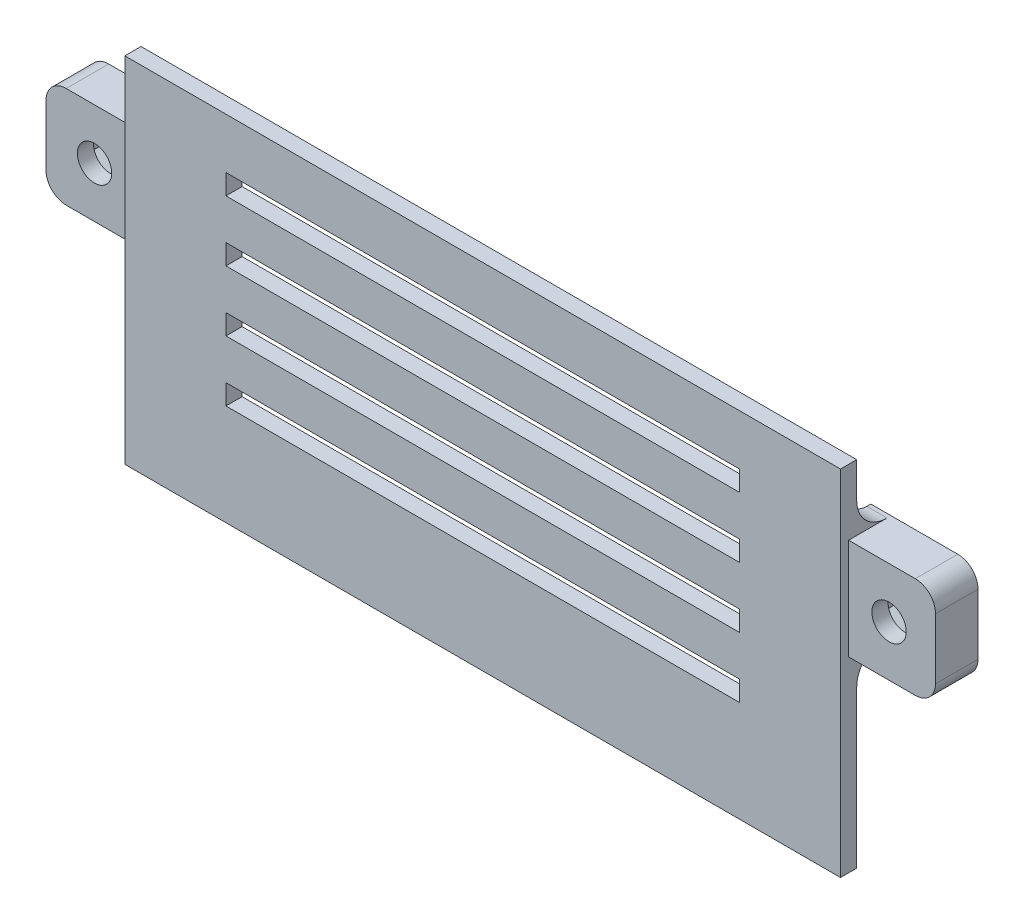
ISO-10303-21;
HEADER;
FILE_DESCRIPTION(('STEP AP214'),'2;1');
FILE_NAME('part.step','',(''),(''),'','','');
FILE_SCHEMA(('AUTOMOTIVE_DESIGN { 1 0 10303 214 1 1 1 1 }'));
ENDSEC;
DATA;
#1=APPLICATION_CONTEXT('core data for automotive mechanical design processes');
#2=APPLICATION_PROTOCOL_DEFINITION('international standard','automotive_design',2000,#1);
#3=PRODUCT_CONTEXT('',#1,'mechanical');
#4=PRODUCT('Part','Part','',(#3));
#5=PRODUCT_RELATED_PRODUCT_CATEGORY('part','',(#4));
#6=PRODUCT_DEFINITION_FORMATION('','',#4);
#7=PRODUCT_DEFINITION_CONTEXT('part definition',#1,'design');
#8=PRODUCT_DEFINITION('design','',#6,#7);
#9=PRODUCT_DEFINITION_SHAPE('','',#8);
#10=(LENGTH_UNIT() NAMED_UNIT(*) SI_UNIT(.MILLI.,.METRE.));
#11=(NAMED_UNIT(*) PLANE_ANGLE_UNIT() SI_UNIT($,.RADIAN.));
#12=(NAMED_UNIT(*) SI_UNIT($,.STERADIAN.) SOLID_ANGLE_UNIT());
#13=UNCERTAINTY_MEASURE_WITH_UNIT(LENGTH_MEASURE(1.E-05),#10,'distance_accuracy_value','');
#14=(GEOMETRIC_REPRESENTATION_CONTEXT(3) GLOBAL_UNCERTAINTY_ASSIGNED_CONTEXT((#13)) GLOBAL_UNIT_ASSIGNED_CONTEXT((#10,
#11,#12)) REPRESENTATION_CONTEXT('',''));
#15=CARTESIAN_POINT('',(0.,0.,0.));
#16=DIRECTION('',(0.,0.,1.));
#17=DIRECTION('',(1.,0.,0.));
#18=AXIS2_PLACEMENT_3D('',#15,#16,#17);
#19=CARTESIAN_POINT('',(-33.3241617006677,-16.5357749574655,-3.4));
#20=DIRECTION('',(0.,-1.,0.));
#21=DIRECTION('',(0.,0.,-1.));
#22=AXIS2_PLACEMENT_3D('',#19,#20,#21);
#23=PLANE('',#22);
#24=DIRECTION('',(1.,0.,0.));
#25=VECTOR('',#24,1.);
#26=CARTESIAN_POINT('',(-41.9241617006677,-16.5357749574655,0.8));
#27=LINE('',#26,#25);
#28=CARTESIAN_POINT('',(-39.9241617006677,-16.5357749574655,0.8));
#29=VERTEX_POINT('',#28);
#30=CARTESIAN_POINT('',(-33.3241617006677,-16.5357749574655,0.8));
#31=VERTEX_POINT('',#30);
#32=EDGE_CURVE('E486',#29,#31,#27,.T.);
#33=ORIENTED_EDGE('',*,*,#32,.F.);
#34=DIRECTION('',(0.,0.,1.));
#35=VECTOR('',#34,1.);
#36=CARTESIAN_POINT('',(-39.9241617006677,-16.5357749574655,-3.4));
#37=LINE('',#36,#35);
#38=CARTESIAN_POINT('',(-39.9241617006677,-16.5357749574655,-3.4));
#39=VERTEX_POINT('',#38);
#40=EDGE_CURVE('E11',#29,#39,#37,.F.);
#41=ORIENTED_EDGE('',*,*,#40,.T.);
#42=DIRECTION('',(1.,0.,0.));
#43=VECTOR('',#42,1.);
#44=CARTESIAN_POINT('',(-33.3241617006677,-16.5357749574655,-3.4));
#45=LINE('',#44,#43);
#46=CARTESIAN_POINT('',(-31.3241617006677,-16.5357749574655,-3.4));
#47=VERTEX_POINT('',#46);
#48=EDGE_CURVE('E532',#39,#47,#45,.T.);
#49=ORIENTED_EDGE('',*,*,#48,.T.);
#50=DIRECTION('',(0.,0.,1.));
#51=VECTOR('',#50,1.);
#52=CARTESIAN_POINT('',(-31.3241617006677,-16.5357749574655,-13.5980390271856));
#53=LINE('',#52,#51);
#54=CARTESIAN_POINT('',(-31.3241617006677,-16.5357749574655,-3.));
#55=VERTEX_POINT('',#54);
#56=EDGE_CURVE('E500',#47,#55,#53,.T.);
#57=ORIENTED_EDGE('',*,*,#56,.T.);
#58=DIRECTION('',(1.,0.,0.));
#59=VECTOR('',#58,1.);
#60=CARTESIAN_POINT('',(-33.3241617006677,-16.5357749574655,-3.));
#61=LINE('',#60,#59);
#62=CARTESIAN_POINT('',(-33.3241617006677,-16.5357749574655,-3.));
#63=VERTEX_POINT('',#62);
#64=EDGE_CURVE('E727',#55,#63,#61,.F.);
#65=ORIENTED_EDGE('',*,*,#64,.T.);
#66=DIRECTION('',(0.,0.,1.));
#67=VECTOR('',#66,1.);
#68=CARTESIAN_POINT('',(-33.3241617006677,-16.5357749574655,-3.4));
#69=LINE('',#68,#67);
#70=EDGE_CURVE('E535',#63,#31,#69,.T.);
#71=ORIENTED_EDGE('',*,*,#70,.T.);
#72=EDGE_LOOP('',(#33,#41,#49,#57,#65,#71));
#73=FACE_BOUND('',#72,.T.);
#74=ADVANCED_FACE('F35',(#73),#23,.T.);
#75=CARTESIAN_POINT('',(-41.9241617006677,-6.53577495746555,-3.4));
#76=DIRECTION('',(-1.,0.,0.));
#77=DIRECTION('',(0.,0.,1.));
#78=AXIS2_PLACEMENT_3D('',#75,#76,#77);
#79=PLANE('',#78);
#80=DIRECTION('',(0.,-1.,0.));
#81=VECTOR('',#80,1.);
#82=CARTESIAN_POINT('',(-41.9241617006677,-6.53577495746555,0.8));
#83=LINE('',#82,#81);
#84=CARTESIAN_POINT('',(-41.9241617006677,-8.53577495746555,0.8));
#85=VERTEX_POINT('',#84);
#86=CARTESIAN_POINT('',(-41.9241617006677,-14.5357749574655,0.8));
#87=VERTEX_POINT('',#86);
#88=EDGE_CURVE('E483',#85,#87,#83,.T.);
#89=ORIENTED_EDGE('',*,*,#88,.F.);
#90=DIRECTION('',(0.,0.,1.));
#91=VECTOR('',#90,1.);
#92=CARTESIAN_POINT('',(-41.9241617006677,-8.53577495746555,-3.4));
#93=LINE('',#92,#91);
#94=CARTESIAN_POINT('',(-41.9241617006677,-8.53577495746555,-3.4));
#95=VERTEX_POINT('',#94);
#96=EDGE_CURVE('E779',#85,#95,#93,.F.);
#97=ORIENTED_EDGE('',*,*,#96,.T.);
#98=DIRECTION('',(0.,-1.,0.));
#99=VECTOR('',#98,1.);
#100=CARTESIAN_POINT('',(-41.9241617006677,-6.53577495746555,-3.4));
#101=LINE('',#100,#99);
#102=CARTESIAN_POINT('',(-41.9241617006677,-14.5357749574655,-3.4));
#103=VERTEX_POINT('',#102);
#104=EDGE_CURVE('E530',#95,#103,#101,.T.);
#105=ORIENTED_EDGE('',*,*,#104,.T.);
#106=DIRECTION('',(0.,0.,1.));
#107=VECTOR('',#106,1.);
#108=CARTESIAN_POINT('',(-41.9241617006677,-14.5357749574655,-3.4));
#109=LINE('',#108,#107);
#110=EDGE_CURVE('E776',#103,#87,#109,.T.);
#111=ORIENTED_EDGE('',*,*,#110,.T.);
#112=EDGE_LOOP('',(#89,#97,#105,#111));
#113=FACE_BOUND('',#112,.T.);
#114=ADVANCED_FACE('F796',(#113),#79,.T.);
#115=CARTESIAN_POINT('',(-33.3241617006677,-6.53577495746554,-3.4));
#116=DIRECTION('',(0.,1.,0.));
#117=DIRECTION('',(-1.,0.,0.));
#118=AXIS2_PLACEMENT_3D('',#115,#116,#117);
#119=PLANE('',#118);
#120=DIRECTION('',(-1.,0.,0.));
#121=VECTOR('',#120,1.);
#122=CARTESIAN_POINT('',(-33.3241617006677,-6.53577495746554,-3.4));
#123=LINE('',#122,#121);
#124=CARTESIAN_POINT('',(-31.3241617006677,-6.53577495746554,-3.4));
#125=VERTEX_POINT('',#124);
#126=CARTESIAN_POINT('',(-39.9241617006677,-6.53577495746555,-3.4));
#127=VERTEX_POINT('',#126);
#128=EDGE_CURVE('E519',#125,#127,#123,.T.);
#129=ORIENTED_EDGE('',*,*,#128,.T.);
#130=DIRECTION('',(0.,0.,1.));
#131=VECTOR('',#130,1.);
#132=CARTESIAN_POINT('',(-39.9241617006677,-6.53577495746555,-3.4));
#133=LINE('',#132,#131);
#134=CARTESIAN_POINT('',(-39.9241617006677,-6.53577495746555,0.8));
#135=VERTEX_POINT('',#134);
#136=EDGE_CURVE('E769',#127,#135,#133,.T.);
#137=ORIENTED_EDGE('',*,*,#136,.T.);
#138=DIRECTION('',(-1.,0.,0.));
#139=VECTOR('',#138,1.);
#140=CARTESIAN_POINT('',(-41.9241617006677,-6.53577495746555,0.8));
#141=LINE('',#140,#139);
#142=CARTESIAN_POINT('',(-33.3241617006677,-6.53577495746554,0.8));
#143=VERTEX_POINT('',#142);
#144=EDGE_CURVE('E490',#143,#135,#141,.T.);
#145=ORIENTED_EDGE('',*,*,#144,.F.);
#146=DIRECTION('',(0.,0.,1.));
#147=VECTOR('',#146,1.);
#148=CARTESIAN_POINT('',(-33.3241617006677,-6.53577495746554,-3.4));
#149=LINE('',#148,#147);
#150=CARTESIAN_POINT('',(-33.3241617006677,-6.53577495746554,-3.));
#151=VERTEX_POINT('',#150);
#152=EDGE_CURVE('E524',#151,#143,#149,.T.);
#153=ORIENTED_EDGE('',*,*,#152,.F.);
#154=DIRECTION('',(-1.,0.,0.));
#155=VECTOR('',#154,1.);
#156=CARTESIAN_POINT('',(-33.3241617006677,-6.53577495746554,-3.));
#157=LINE('',#156,#155);
#158=CARTESIAN_POINT('',(-31.3241617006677,-6.53577495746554,-3.));
#159=VERTEX_POINT('',#158);
#160=EDGE_CURVE('E723',#151,#159,#157,.F.);
#161=ORIENTED_EDGE('',*,*,#160,.T.);
#162=DIRECTION('',(0.,0.,1.));
#163=VECTOR('',#162,1.);
#164=CARTESIAN_POINT('',(-31.3241617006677,-6.53577495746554,-13.5980390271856));
#165=LINE('',#164,#163);
#166=EDGE_CURVE('E506',#125,#159,#165,.T.);
#167=ORIENTED_EDGE('',*,*,#166,.F.);
#168=EDGE_LOOP('',(#129,#137,#145,#153,#161,#167));
#169=FACE_BOUND('',#168,.T.);
#170=ADVANCED_FACE('F789',(#169),#119,.T.);
#171=CARTESIAN_POINT('',(0.,0.,1.6));
#172=DIRECTION('',(0.,0.,1.));
#173=DIRECTION('',(1.,0.,0.));
#174=AXIS2_PLACEMENT_3D('',#171,#172,#173);
#175=PLANE('',#174);
#176=DIRECTION('',(0.,1.,0.));
#177=VECTOR('',#176,1.);
#178=CARTESIAN_POINT('',(37.4758382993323,-0.0357749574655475,1.6));
#179=LINE('',#178,#177);
#180=CARTESIAN_POINT('',(37.4758382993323,-35.0357749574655,1.6));
#181=VERTEX_POINT('',#180);
#182=CARTESIAN_POINT('',(37.4758382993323,-0.0357749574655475,1.6));
#183=VERTEX_POINT('',#182);
#184=EDGE_CURVE('E670',#181,#183,#179,.T.);
#185=ORIENTED_EDGE('',*,*,#184,.T.);
#186=DIRECTION('',(-1.,0.,0.));
#187=VECTOR('',#186,1.);
#188=CARTESIAN_POINT('',(-33.3241617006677,-0.0357749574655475,1.6));
#189=LINE('',#188,#187);
#190=CARTESIAN_POINT('',(-33.3241617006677,-0.0357749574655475,1.6));
#191=VERTEX_POINT('',#190);
#192=EDGE_CURVE('E672',#183,#191,#189,.T.);
#193=ORIENTED_EDGE('',*,*,#192,.T.);
#194=DIRECTION('',(0.,-1.,0.));
#195=VECTOR('',#194,1.);
#196=CARTESIAN_POINT('',(-33.3241617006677,-0.0357749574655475,1.6));
#197=LINE('',#196,#195);
#198=CARTESIAN_POINT('',(-33.3241617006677,-35.0357749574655,1.6));
#199=VERTEX_POINT('',#198);
#200=EDGE_CURVE('E665',#191,#199,#197,.T.);
#201=ORIENTED_EDGE('',*,*,#200,.T.);
#202=DIRECTION('',(1.,0.,0.));
#203=VECTOR('',#202,1.);
#204=CARTESIAN_POINT('',(-33.3241617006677,-35.0357749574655,1.6));
#205=LINE('',#204,#203);
#206=EDGE_CURVE('E667',#199,#181,#205,.T.);
#207=ORIENTED_EDGE('',*,*,#206,.T.);
#208=EDGE_LOOP('',(#185,#193,#201,#207));
#209=FACE_BOUND('',#208,.T.);
#210=DIRECTION('',(1.,0.,0.));
#211=VECTOR('',#210,1.);
#212=CARTESIAN_POINT('',(-23.3241617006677,-7.03577495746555,1.6));
#213=LINE('',#212,#211);
#214=CARTESIAN_POINT('',(-23.3241617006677,-7.03577495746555,1.6));
#215=VERTEX_POINT('',#214);
#216=CARTESIAN_POINT('',(27.4758382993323,-7.03577495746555,1.6));
#217=VERTEX_POINT('',#216);
#218=EDGE_CURVE('E636',#215,#217,#213,.T.);
#219=ORIENTED_EDGE('',*,*,#218,.F.);
#220=DIRECTION('',(0.,-1.,0.));
#221=VECTOR('',#220,1.);
#222=CARTESIAN_POINT('',(-23.3241617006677,-5.03577495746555,1.6));
#223=LINE('',#222,#221);
#224=CARTESIAN_POINT('',(-23.3241617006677,-5.03577495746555,1.6));
#225=VERTEX_POINT('',#224);
#226=EDGE_CURVE('E634',#225,#215,#223,.T.);
#227=ORIENTED_EDGE('',*,*,#226,.F.);
#228=DIRECTION('',(-1.,0.,0.));
#229=VECTOR('',#228,1.);
#230=CARTESIAN_POINT('',(-23.3241617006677,-5.03577495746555,1.6));
#231=LINE('',#230,#229);
#232=CARTESIAN_POINT('',(27.4758382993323,-5.03577495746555,1.6));
#233=VERTEX_POINT('',#232);
#234=EDGE_CURVE('E642',#233,#225,#231,.T.);
#235=ORIENTED_EDGE('',*,*,#234,.F.);
#236=DIRECTION('',(0.,1.,0.));
#237=VECTOR('',#236,1.);
#238=CARTESIAN_POINT('',(27.4758382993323,-5.03577495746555,1.6));
#239=LINE('',#238,#237);
#240=EDGE_CURVE('E639',#217,#233,#239,.T.);
#241=ORIENTED_EDGE('',*,*,#240,.F.);
#242=EDGE_LOOP('',(#219,#227,#235,#241));
#243=FACE_BOUND('',#242,.T.);
#244=DIRECTION('',(1.,0.,0.));
#245=VECTOR('',#244,1.);
#246=CARTESIAN_POINT('',(-23.3241617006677,-13.0357749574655,1.6));
#247=LINE('',#246,#245);
#248=CARTESIAN_POINT('',(-23.3241617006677,-13.0357749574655,1.6));
#249=VERTEX_POINT('',#248);
#250=CARTESIAN_POINT('',(27.4758382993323,-13.0357749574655,1.6));
#251=VERTEX_POINT('',#250);
#252=EDGE_CURVE('E605',#249,#251,#247,.T.);
#253=ORIENTED_EDGE('',*,*,#252,.F.);
#254=DIRECTION('',(0.,-1.,0.));
#255=VECTOR('',#254,1.);
#256=CARTESIAN_POINT('',(-23.3241617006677,-11.0357749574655,1.6));
#257=LINE('',#256,#255);
#258=CARTESIAN_POINT('',(-23.3241617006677,-11.0357749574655,1.6));
#259=VERTEX_POINT('',#258);
#260=EDGE_CURVE('E603',#259,#249,#257,.T.);
#261=ORIENTED_EDGE('',*,*,#260,.F.);
#262=DIRECTION('',(-1.,0.,0.));
#263=VECTOR('',#262,1.);
#264=CARTESIAN_POINT('',(-23.3241617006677,-11.0357749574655,1.6));
#265=LINE('',#264,#263);
#266=CARTESIAN_POINT('',(27.4758382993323,-11.0357749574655,1.6));
#267=VERTEX_POINT('',#266);
#268=EDGE_CURVE('E611',#267,#259,#265,.T.);
#269=ORIENTED_EDGE('',*,*,#268,.F.);
#270=DIRECTION('',(0.,1.,0.));
#271=VECTOR('',#270,1.);
#272=CARTESIAN_POINT('',(27.4758382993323,-11.0357749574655,1.6));
#273=LINE('',#272,#271);
#274=EDGE_CURVE('E608',#251,#267,#273,.T.);
#275=ORIENTED_EDGE('',*,*,#274,.F.);
#276=EDGE_LOOP('',(#253,#261,#269,#275));
#277=FACE_BOUND('',#276,.T.);
#278=DIRECTION('',(1.,0.,0.));
#279=VECTOR('',#278,1.);
#280=CARTESIAN_POINT('',(-23.3241617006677,-19.0357749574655,1.6));
#281=LINE('',#280,#279);
#282=CARTESIAN_POINT('',(-23.3241617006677,-19.0357749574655,1.6));
#283=VERTEX_POINT('',#282);
#284=CARTESIAN_POINT('',(27.4758382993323,-19.0357749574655,1.6));
#285=VERTEX_POINT('',#284);
#286=EDGE_CURVE('E574',#283,#285,#281,.T.);
#287=ORIENTED_EDGE('',*,*,#286,.F.);
#288=DIRECTION('',(0.,-1.,0.));
#289=VECTOR('',#288,1.);
#290=CARTESIAN_POINT('',(-23.3241617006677,-17.0357749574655,1.6));
#291=LINE('',#290,#289);
#292=CARTESIAN_POINT('',(-23.3241617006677,-17.0357749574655,1.6));
#293=VERTEX_POINT('',#292);
#294=EDGE_CURVE('E572',#293,#283,#291,.T.);
#295=ORIENTED_EDGE('',*,*,#294,.F.);
#296=DIRECTION('',(-1.,0.,0.));
#297=VECTOR('',#296,1.);
#298=CARTESIAN_POINT('',(-23.3241617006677,-17.0357749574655,1.6));
#299=LINE('',#298,#297);
#300=CARTESIAN_POINT('',(27.4758382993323,-17.0357749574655,1.6));
#301=VERTEX_POINT('',#300);
#302=EDGE_CURVE('E580',#301,#293,#299,.T.);
#303=ORIENTED_EDGE('',*,*,#302,.F.);
#304=DIRECTION('',(0.,1.,0.));
#305=VECTOR('',#304,1.);
#306=CARTESIAN_POINT('',(27.4758382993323,-17.0357749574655,1.6));
#307=LINE('',#306,#305);
#308=EDGE_CURVE('E577',#285,#301,#307,.T.);
#309=ORIENTED_EDGE('',*,*,#308,.F.);
#310=EDGE_LOOP('',(#287,#295,#303,#309));
#311=FACE_BOUND('',#310,.T.);
#312=DIRECTION('',(1.,0.,0.));
#313=VECTOR('',#312,1.);
#314=CARTESIAN_POINT('',(-23.3241617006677,-25.0357749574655,1.6));
#315=LINE('',#314,#313);
#316=CARTESIAN_POINT('',(-23.3241617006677,-25.0357749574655,1.6));
#317=VERTEX_POINT('',#316);
#318=CARTESIAN_POINT('',(27.4758382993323,-25.0357749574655,1.6));
#319=VERTEX_POINT('',#318);
#320=EDGE_CURVE('E543',#317,#319,#315,.T.);
#321=ORIENTED_EDGE('',*,*,#320,.F.);
#322=DIRECTION('',(0.,-1.,0.));
#323=VECTOR('',#322,1.);
#324=CARTESIAN_POINT('',(-23.3241617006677,-23.0357749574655,1.6));
#325=LINE('',#324,#323);
#326=CARTESIAN_POINT('',(-23.3241617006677,-23.0357749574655,1.6));
#327=VERTEX_POINT('',#326);
#328=EDGE_CURVE('E541',#327,#317,#325,.T.);
#329=ORIENTED_EDGE('',*,*,#328,.F.);
#330=DIRECTION('',(-1.,0.,0.));
#331=VECTOR('',#330,1.);
#332=CARTESIAN_POINT('',(-23.3241617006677,-23.0357749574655,1.6));
#333=LINE('',#332,#331);
#334=CARTESIAN_POINT('',(27.4758382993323,-23.0357749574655,1.6));
#335=VERTEX_POINT('',#334);
#336=EDGE_CURVE('E549',#335,#327,#333,.T.);
#337=ORIENTED_EDGE('',*,*,#336,.F.);
#338=DIRECTION('',(0.,1.,0.));
#339=VECTOR('',#338,1.);
#340=CARTESIAN_POINT('',(27.4758382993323,-23.0357749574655,1.6));
#341=LINE('',#340,#339);
#342=EDGE_CURVE('E546',#319,#335,#341,.T.);
#343=ORIENTED_EDGE('',*,*,#342,.F.);
#344=EDGE_LOOP('',(#321,#329,#337,#343));
#345=FACE_BOUND('',#344,.T.);
#346=ADVANCED_FACE('F835',(#209,#243,#277,#311,#345),#175,.T.);
#347=CARTESIAN_POINT('',(0.,0.,0.));
#348=DIRECTION('',(0.,0.,1.));
#349=DIRECTION('',(1.,0.,0.));
#350=AXIS2_PLACEMENT_3D('',#347,#348,#349);
#351=PLANE('',#350);
#352=DIRECTION('',(0.,-1.,0.));
#353=VECTOR('',#352,1.);
#354=CARTESIAN_POINT('',(-23.3241617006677,-17.0357749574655,0.));
#355=LINE('',#354,#353);
#356=CARTESIAN_POINT('',(-23.3241617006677,-17.0357749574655,0.));
#357=VERTEX_POINT('',#356);
#358=CARTESIAN_POINT('',(-23.3241617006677,-19.0357749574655,0.));
#359=VERTEX_POINT('',#358);
#360=EDGE_CURVE('E571',#357,#359,#355,.T.);
#361=ORIENTED_EDGE('',*,*,#360,.T.);
#362=DIRECTION('',(1.,0.,0.));
#363=VECTOR('',#362,1.);
#364=CARTESIAN_POINT('',(-23.3241617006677,-19.0357749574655,0.));
#365=LINE('',#364,#363);
#366=CARTESIAN_POINT('',(27.4758382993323,-19.0357749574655,0.));
#367=VERTEX_POINT('',#366);
#368=EDGE_CURVE('E585',#359,#367,#365,.T.);
#369=ORIENTED_EDGE('',*,*,#368,.T.);
#370=DIRECTION('',(0.,1.,0.));
#371=VECTOR('',#370,1.);
#372=CARTESIAN_POINT('',(27.4758382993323,-17.0357749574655,0.));
#373=LINE('',#372,#371);
#374=CARTESIAN_POINT('',(27.4758382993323,-17.0357749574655,0.));
#375=VERTEX_POINT('',#374);
#376=EDGE_CURVE('E588',#367,#375,#373,.T.);
#377=ORIENTED_EDGE('',*,*,#376,.T.);
#378=DIRECTION('',(-1.,0.,0.));
#379=VECTOR('',#378,1.);
#380=CARTESIAN_POINT('',(-23.3241617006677,-17.0357749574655,0.));
#381=LINE('',#380,#379);
#382=EDGE_CURVE('E575',#375,#357,#381,.T.);
#383=ORIENTED_EDGE('',*,*,#382,.T.);
#384=EDGE_LOOP('',(#361,#369,#377,#383));
#385=FACE_BOUND('',#384,.T.);
#386=DIRECTION('',(0.,-1.,0.));
#387=VECTOR('',#386,1.);
#388=CARTESIAN_POINT('',(-23.3241617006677,-5.03577495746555,0.));
#389=LINE('',#388,#387);
#390=CARTESIAN_POINT('',(-23.3241617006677,-5.03577495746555,0.));
#391=VERTEX_POINT('',#390);
#392=CARTESIAN_POINT('',(-23.3241617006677,-7.03577495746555,0.));
#393=VERTEX_POINT('',#392);
#394=EDGE_CURVE('E633',#391,#393,#389,.T.);
#395=ORIENTED_EDGE('',*,*,#394,.T.);
#396=DIRECTION('',(1.,0.,0.));
#397=VECTOR('',#396,1.);
#398=CARTESIAN_POINT('',(-23.3241617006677,-7.03577495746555,0.));
#399=LINE('',#398,#397);
#400=CARTESIAN_POINT('',(27.4758382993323,-7.03577495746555,0.));
#401=VERTEX_POINT('',#400);
#402=EDGE_CURVE('E647',#393,#401,#399,.T.);
#403=ORIENTED_EDGE('',*,*,#402,.T.);
#404=DIRECTION('',(0.,1.,0.));
#405=VECTOR('',#404,1.);
#406=CARTESIAN_POINT('',(27.4758382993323,-5.03577495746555,0.));
#407=LINE('',#406,#405);
#408=CARTESIAN_POINT('',(27.4758382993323,-5.03577495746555,0.));
#409=VERTEX_POINT('',#408);
#410=EDGE_CURVE('E650',#401,#409,#407,.T.);
#411=ORIENTED_EDGE('',*,*,#410,.T.);
#412=DIRECTION('',(-1.,0.,0.));
#413=VECTOR('',#412,1.);
#414=CARTESIAN_POINT('',(-23.3241617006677,-5.03577495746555,0.));
#415=LINE('',#414,#413);
#416=EDGE_CURVE('E637',#409,#391,#415,.T.);
#417=ORIENTED_EDGE('',*,*,#416,.T.);
#418=EDGE_LOOP('',(#395,#403,#411,#417));
#419=FACE_BOUND('',#418,.T.);
#420=DIRECTION('',(0.,-1.,0.));
#421=VECTOR('',#420,1.);
#422=CARTESIAN_POINT('',(32.4758382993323,0.,0.));
#423=LINE('',#422,#421);
#424=CARTESIAN_POINT('',(32.4758382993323,-3.53577495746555,0.));
#425=VERTEX_POINT('',#424);
#426=CARTESIAN_POINT('',(32.4758382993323,-19.5357749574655,0.));
#427=VERTEX_POINT('',#426);
#428=EDGE_CURVE('E711',#425,#427,#423,.T.);
#429=ORIENTED_EDGE('',*,*,#428,.T.);
#430=DIRECTION('',(1.,0.,0.));
#431=VECTOR('',#430,1.);
#432=CARTESIAN_POINT('',(0.,-19.5357749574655,0.));
#433=LINE('',#432,#431);
#434=CARTESIAN_POINT('',(37.4758382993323,-19.5357749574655,0.));
#435=VERTEX_POINT('',#434);
#436=EDGE_CURVE('E713',#427,#435,#433,.T.);
#437=ORIENTED_EDGE('',*,*,#436,.T.);
#438=DIRECTION('',(0.,1.,0.));
#439=VECTOR('',#438,1.);
#440=CARTESIAN_POINT('',(37.4758382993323,-0.0357749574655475,0.));
#441=LINE('',#440,#439);
#442=CARTESIAN_POINT('',(37.4758382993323,-35.0357749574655,0.));
#443=VERTEX_POINT('',#442);
#444=EDGE_CURVE('E681',#443,#435,#441,.T.);
#445=ORIENTED_EDGE('',*,*,#444,.F.);
#446=DIRECTION('',(1.,0.,0.));
#447=VECTOR('',#446,1.);
#448=CARTESIAN_POINT('',(-33.3241617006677,-35.0357749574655,0.));
#449=LINE('',#448,#447);
#450=CARTESIAN_POINT('',(-33.3241617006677,-35.0357749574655,0.));
#451=VERTEX_POINT('',#450);
#452=EDGE_CURVE('E678',#451,#443,#449,.T.);
#453=ORIENTED_EDGE('',*,*,#452,.F.);
#454=DIRECTION('',(0.,-1.,0.));
#455=VECTOR('',#454,1.);
#456=CARTESIAN_POINT('',(-33.3241617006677,-0.0357749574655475,0.));
#457=LINE('',#456,#455);
#458=CARTESIAN_POINT('',(-33.3241617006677,-19.5357749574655,0.));
#459=VERTEX_POINT('',#458);
#460=EDGE_CURVE('E664',#459,#451,#457,.T.);
#461=ORIENTED_EDGE('',*,*,#460,.F.);
#462=DIRECTION('',(1.,0.,0.));
#463=VECTOR('',#462,1.);
#464=CARTESIAN_POINT('',(0.,-19.5357749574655,0.));
#465=LINE('',#464,#463);
#466=CARTESIAN_POINT('',(-28.3241617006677,-19.5357749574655,0.));
#467=VERTEX_POINT('',#466);
#468=EDGE_CURVE('E527',#459,#467,#465,.T.);
#469=ORIENTED_EDGE('',*,*,#468,.T.);
#470=DIRECTION('',(0.,1.,0.));
#471=VECTOR('',#470,1.);
#472=CARTESIAN_POINT('',(-28.3241617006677,0.,0.));
#473=LINE('',#472,#471);
#474=CARTESIAN_POINT('',(-28.3241617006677,-3.53577495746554,0.));
#475=VERTEX_POINT('',#474);
#476=EDGE_CURVE('E704',#467,#475,#473,.T.);
#477=ORIENTED_EDGE('',*,*,#476,.T.);
#478=DIRECTION('',(-1.,0.,0.));
#479=VECTOR('',#478,1.);
#480=CARTESIAN_POINT('',(0.,-3.53577495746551,0.));
#481=LINE('',#480,#479);
#482=CARTESIAN_POINT('',(-33.3241617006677,-3.53577495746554,0.));
#483=VERTEX_POINT('',#482);
#484=EDGE_CURVE('E706',#475,#483,#481,.T.);
#485=ORIENTED_EDGE('',*,*,#484,.T.);
#486=CARTESIAN_POINT('',(-33.3241617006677,-0.0357749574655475,0.));
#487=VERTEX_POINT('',#486);
#488=EDGE_CURVE('E675',#487,#483,#457,.T.);
#489=ORIENTED_EDGE('',*,*,#488,.F.);
#490=DIRECTION('',(-1.,0.,0.));
#491=VECTOR('',#490,1.);
#492=CARTESIAN_POINT('',(-33.3241617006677,-0.0357749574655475,0.));
#493=LINE('',#492,#491);
#494=CARTESIAN_POINT('',(37.4758382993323,-0.0357749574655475,0.));
#495=VERTEX_POINT('',#494);
#496=EDGE_CURVE('E668',#495,#487,#493,.T.);
#497=ORIENTED_EDGE('',*,*,#496,.F.);
#498=CARTESIAN_POINT('',(37.4758382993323,-3.53577495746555,0.));
#499=VERTEX_POINT('',#498);
#500=EDGE_CURVE('E680',#499,#495,#441,.T.);
#501=ORIENTED_EDGE('',*,*,#500,.F.);
#502=DIRECTION('',(-1.,0.,0.));
#503=VECTOR('',#502,1.);
#504=CARTESIAN_POINT('',(0.,-3.53577495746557,0.));
#505=LINE('',#504,#503);
#506=EDGE_CURVE('E709',#499,#425,#505,.T.);
#507=ORIENTED_EDGE('',*,*,#506,.T.);
#508=EDGE_LOOP('',(#429,#437,#445,#453,#461,#469,#477,#485,#489,#497,#501,#507));
#509=FACE_BOUND('',#508,.T.);
#510=DIRECTION('',(0.,-1.,0.));
#511=VECTOR('',#510,1.);
#512=CARTESIAN_POINT('',(-23.3241617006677,-11.0357749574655,0.));
#513=LINE('',#512,#511);
#514=CARTESIAN_POINT('',(-23.3241617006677,-11.0357749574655,0.));
#515=VERTEX_POINT('',#514);
#516=CARTESIAN_POINT('',(-23.3241617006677,-13.0357749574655,0.));
#517=VERTEX_POINT('',#516);
#518=EDGE_CURVE('E602',#515,#517,#513,.T.);
#519=ORIENTED_EDGE('',*,*,#518,.T.);
#520=DIRECTION('',(1.,0.,0.));
#521=VECTOR('',#520,1.);
#522=CARTESIAN_POINT('',(-23.3241617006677,-13.0357749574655,0.));
#523=LINE('',#522,#521);
#524=CARTESIAN_POINT('',(27.4758382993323,-13.0357749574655,0.));
#525=VERTEX_POINT('',#524);
#526=EDGE_CURVE('E616',#517,#525,#523,.T.);
#527=ORIENTED_EDGE('',*,*,#526,.T.);
#528=DIRECTION('',(0.,1.,0.));
#529=VECTOR('',#528,1.);
#530=CARTESIAN_POINT('',(27.4758382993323,-11.0357749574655,0.));
#531=LINE('',#530,#529);
#532=CARTESIAN_POINT('',(27.4758382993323,-11.0357749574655,0.));
#533=VERTEX_POINT('',#532);
#534=EDGE_CURVE('E619',#525,#533,#531,.T.);
#535=ORIENTED_EDGE('',*,*,#534,.T.);
#536=DIRECTION('',(-1.,0.,0.));
#537=VECTOR('',#536,1.);
#538=CARTESIAN_POINT('',(-23.3241617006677,-11.0357749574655,0.));
#539=LINE('',#538,#537);
#540=EDGE_CURVE('E606',#533,#515,#539,.T.);
#541=ORIENTED_EDGE('',*,*,#540,.T.);
#542=EDGE_LOOP('',(#519,#527,#535,#541));
#543=FACE_BOUND('',#542,.T.);
#544=DIRECTION('',(0.,-1.,0.));
#545=VECTOR('',#544,1.);
#546=CARTESIAN_POINT('',(-23.3241617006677,-23.0357749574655,0.));
#547=LINE('',#546,#545);
#548=CARTESIAN_POINT('',(-23.3241617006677,-23.0357749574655,0.));
#549=VERTEX_POINT('',#548);
#550=CARTESIAN_POINT('',(-23.3241617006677,-25.0357749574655,0.));
#551=VERTEX_POINT('',#550);
#552=EDGE_CURVE('E534',#549,#551,#547,.T.);
#553=ORIENTED_EDGE('',*,*,#552,.T.);
#554=DIRECTION('',(1.,0.,0.));
#555=VECTOR('',#554,1.);
#556=CARTESIAN_POINT('',(-23.3241617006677,-25.0357749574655,0.));
#557=LINE('',#556,#555);
#558=CARTESIAN_POINT('',(27.4758382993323,-25.0357749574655,0.));
#559=VERTEX_POINT('',#558);
#560=EDGE_CURVE('E554',#551,#559,#557,.T.);
#561=ORIENTED_EDGE('',*,*,#560,.T.);
#562=DIRECTION('',(0.,1.,0.));
#563=VECTOR('',#562,1.);
#564=CARTESIAN_POINT('',(27.4758382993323,-23.0357749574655,0.));
#565=LINE('',#564,#563);
#566=CARTESIAN_POINT('',(27.4758382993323,-23.0357749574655,0.));
#567=VERTEX_POINT('',#566);
#568=EDGE_CURVE('E557',#559,#567,#565,.T.);
#569=ORIENTED_EDGE('',*,*,#568,.T.);
#570=DIRECTION('',(-1.,0.,0.));
#571=VECTOR('',#570,1.);
#572=CARTESIAN_POINT('',(-23.3241617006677,-23.0357749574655,0.));
#573=LINE('',#572,#571);
#574=EDGE_CURVE('E544',#567,#549,#573,.T.);
#575=ORIENTED_EDGE('',*,*,#574,.T.);
#576=EDGE_LOOP('',(#553,#561,#569,#575));
#577=FACE_BOUND('',#576,.T.);
#578=ADVANCED_FACE('F823',(#385,#419,#509,#543,#577),#351,.F.);
#579=CARTESIAN_POINT('',(-33.3241617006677,-0.0357749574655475,1.6));
#580=DIRECTION('',(1.,0.,0.));
#581=DIRECTION('',(0.,1.,0.));
#582=AXIS2_PLACEMENT_3D('',#579,#580,#581);
#583=PLANE('',#582);
#584=ORIENTED_EDGE('',*,*,#488,.T.);
#585=CARTESIAN_POINT('',(-33.3241617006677,-3.53577495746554,-3.));
#586=DIRECTION('',(1.,0.,0.));
#587=DIRECTION('',(0.,1.,0.));
#588=AXIS2_PLACEMENT_3D('',#585,#586,#587);
#589=CIRCLE('',#588,3.);
#590=EDGE_CURVE('E735',#483,#151,#589,.T.);
#591=ORIENTED_EDGE('',*,*,#590,.T.);
#592=ORIENTED_EDGE('',*,*,#152,.T.);
#593=DIRECTION('',(0.,1.,0.));
#594=VECTOR('',#593,1.);
#595=CARTESIAN_POINT('',(-33.3241617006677,-6.53577495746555,0.8));
#596=LINE('',#595,#594);
#597=EDGE_CURVE('E488',#31,#143,#596,.T.);
#598=ORIENTED_EDGE('',*,*,#597,.F.);
#599=ORIENTED_EDGE('',*,*,#70,.F.);
#600=CARTESIAN_POINT('',(-33.3241617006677,-19.5357749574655,-3.));
#601=DIRECTION('',(1.,0.,0.));
#602=DIRECTION('',(0.,1.,0.));
#603=AXIS2_PLACEMENT_3D('',#600,#601,#602);
#604=CIRCLE('',#603,3.);
#605=EDGE_CURVE('E738',#63,#459,#604,.T.);
#606=ORIENTED_EDGE('',*,*,#605,.T.);
#607=ORIENTED_EDGE('',*,*,#460,.T.);
#608=DIRECTION('',(0.,0.,-1.));
#609=VECTOR('',#608,1.);
#610=CARTESIAN_POINT('',(-33.3241617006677,-35.0357749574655,1.6));
#611=LINE('',#610,#609);
#612=EDGE_CURVE('E538',#199,#451,#611,.T.);
#613=ORIENTED_EDGE('',*,*,#612,.F.);
#614=ORIENTED_EDGE('',*,*,#200,.F.);
#615=DIRECTION('',(0.,0.,-1.));
#616=VECTOR('',#615,1.);
#617=CARTESIAN_POINT('',(-33.3241617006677,-0.0357749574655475,1.6));
#618=LINE('',#617,#616);
#619=EDGE_CURVE('E674',#191,#487,#618,.T.);
#620=ORIENTED_EDGE('',*,*,#619,.T.);
#621=EDGE_LOOP('',(#584,#591,#592,#598,#599,#606,#607,#613,#614,#620));
#622=FACE_BOUND('',#621,.T.);
#623=ADVANCED_FACE('F803',(#622),#583,.F.);
#624=CARTESIAN_POINT('',(-33.3241617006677,-35.0357749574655,1.6));
#625=DIRECTION('',(0.,1.,0.));
#626=DIRECTION('',(0.,0.,1.));
#627=AXIS2_PLACEMENT_3D('',#624,#625,#626);
#628=PLANE('',#627);
#629=ORIENTED_EDGE('',*,*,#452,.T.);
#630=DIRECTION('',(0.,0.,-1.));
#631=VECTOR('',#630,1.);
#632=CARTESIAN_POINT('',(37.4758382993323,-35.0357749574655,1.6));
#633=LINE('',#632,#631);
#634=EDGE_CURVE('E690',#181,#443,#633,.T.);
#635=ORIENTED_EDGE('',*,*,#634,.F.);
#636=ORIENTED_EDGE('',*,*,#206,.F.);
#637=ORIENTED_EDGE('',*,*,#612,.T.);
#638=EDGE_LOOP('',(#629,#635,#636,#637));
#639=FACE_BOUND('',#638,.T.);
#640=ADVANCED_FACE('F831',(#639),#628,.F.);
#641=CARTESIAN_POINT('',(37.4758382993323,-0.0357749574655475,1.6));
#642=DIRECTION('',(-1.,0.,0.));
#643=DIRECTION('',(0.,-1.,0.));
#644=AXIS2_PLACEMENT_3D('',#641,#642,#643);
#645=PLANE('',#644);
#646=ORIENTED_EDGE('',*,*,#444,.T.);
#647=CARTESIAN_POINT('',(37.4758382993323,-19.5357749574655,-3.));
#648=DIRECTION('',(-1.,0.,0.));
#649=DIRECTION('',(0.,-1.,0.));
#650=AXIS2_PLACEMENT_3D('',#647,#648,#649);
#651=CIRCLE('',#650,3.);
#652=CARTESIAN_POINT('',(37.4758382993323,-16.5357749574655,-3.));
#653=VERTEX_POINT('',#652);
#654=EDGE_CURVE('E730',#435,#653,#651,.T.);
#655=ORIENTED_EDGE('',*,*,#654,.T.);
#656=DIRECTION('',(0.,0.,1.));
#657=VECTOR('',#656,1.);
#658=CARTESIAN_POINT('',(37.4758382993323,-16.5357749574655,-3.4));
#659=LINE('',#658,#657);
#660=CARTESIAN_POINT('',(37.4758382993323,-16.5357749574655,0.8));
#661=VERTEX_POINT('',#660);
#662=EDGE_CURVE('E523',#653,#661,#659,.T.);
#663=ORIENTED_EDGE('',*,*,#662,.T.);
#664=DIRECTION('',(0.,-1.,0.));
#665=VECTOR('',#664,1.);
#666=CARTESIAN_POINT('',(37.4758382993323,-6.53577495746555,0.8));
#667=LINE('',#666,#665);
#668=CARTESIAN_POINT('',(37.4758382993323,-6.53577495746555,0.8));
#669=VERTEX_POINT('',#668);
#670=EDGE_CURVE('E478',#669,#661,#667,.T.);
#671=ORIENTED_EDGE('',*,*,#670,.F.);
#672=DIRECTION('',(0.,0.,1.));
#673=VECTOR('',#672,1.);
#674=CARTESIAN_POINT('',(37.4758382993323,-6.53577495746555,-3.4));
#675=LINE('',#674,#673);
#676=CARTESIAN_POINT('',(37.4758382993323,-6.53577495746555,-3.));
#677=VERTEX_POINT('',#676);
#678=EDGE_CURVE('E520',#677,#669,#675,.T.);
#679=ORIENTED_EDGE('',*,*,#678,.F.);
#680=CARTESIAN_POINT('',(37.4758382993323,-3.53577495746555,-3.));
#681=DIRECTION('',(-1.,0.,0.));
#682=DIRECTION('',(0.,-1.,0.));
#683=AXIS2_PLACEMENT_3D('',#680,#681,#682);
#684=CIRCLE('',#683,3.);
#685=EDGE_CURVE('E733',#677,#499,#684,.T.);
#686=ORIENTED_EDGE('',*,*,#685,.T.);
#687=ORIENTED_EDGE('',*,*,#500,.T.);
#688=DIRECTION('',(0.,0.,-1.));
#689=VECTOR('',#688,1.);
#690=CARTESIAN_POINT('',(37.4758382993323,-0.0357749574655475,1.6));
#691=LINE('',#690,#689);
#692=EDGE_CURVE('E687',#183,#495,#691,.T.);
#693=ORIENTED_EDGE('',*,*,#692,.F.);
#694=ORIENTED_EDGE('',*,*,#184,.F.);
#695=ORIENTED_EDGE('',*,*,#634,.T.);
#696=EDGE_LOOP('',(#646,#655,#663,#671,#679,#686,#687,#693,#694,#695));
#697=FACE_BOUND('',#696,.T.);
#698=ADVANCED_FACE('F858',(#697),#645,.F.);
#699=CARTESIAN_POINT('',(-33.3241617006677,-0.0357749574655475,1.6));
#700=DIRECTION('',(0.,-1.,0.));
#701=DIRECTION('',(0.,0.,-1.));
#702=AXIS2_PLACEMENT_3D('',#699,#700,#701);
#703=PLANE('',#702);
#704=ORIENTED_EDGE('',*,*,#496,.T.);
#705=ORIENTED_EDGE('',*,*,#619,.F.);
#706=ORIENTED_EDGE('',*,*,#192,.F.);
#707=ORIENTED_EDGE('',*,*,#692,.T.);
#708=EDGE_LOOP('',(#704,#705,#706,#707));
#709=FACE_BOUND('',#708,.T.);
#710=ADVANCED_FACE('F841',(#709),#703,.F.);
#711=CARTESIAN_POINT('',(-23.3241617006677,-5.03577495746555,1.6));
#712=DIRECTION('',(1.,0.,0.));
#713=DIRECTION('',(0.,0.,-1.));
#714=AXIS2_PLACEMENT_3D('',#711,#712,#713);
#715=PLANE('',#714);
#716=ORIENTED_EDGE('',*,*,#394,.F.);
#717=DIRECTION('',(0.,0.,-1.));
#718=VECTOR('',#717,1.);
#719=CARTESIAN_POINT('',(-23.3241617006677,-5.03577495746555,1.6));
#720=LINE('',#719,#718);
#721=EDGE_CURVE('E644',#225,#391,#720,.T.);
#722=ORIENTED_EDGE('',*,*,#721,.F.);
#723=ORIENTED_EDGE('',*,*,#226,.T.);
#724=DIRECTION('',(0.,0.,-1.));
#725=VECTOR('',#724,1.);
#726=CARTESIAN_POINT('',(-23.3241617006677,-7.03577495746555,1.6));
#727=LINE('',#726,#725);
#728=EDGE_CURVE('E661',#215,#393,#727,.T.);
#729=ORIENTED_EDGE('',*,*,#728,.T.);
#730=EDGE_LOOP('',(#716,#722,#723,#729));
#731=FACE_BOUND('',#730,.T.);
#732=ADVANCED_FACE('F971',(#731),#715,.T.);
#733=CARTESIAN_POINT('',(-23.3241617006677,-7.03577495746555,1.6));
#734=DIRECTION('',(0.,1.,0.));
#735=DIRECTION('',(-1.,0.,0.));
#736=AXIS2_PLACEMENT_3D('',#733,#734,#735);
#737=PLANE('',#736);
#738=ORIENTED_EDGE('',*,*,#402,.F.);
#739=ORIENTED_EDGE('',*,*,#728,.F.);
#740=ORIENTED_EDGE('',*,*,#218,.T.);
#741=DIRECTION('',(0.,0.,-1.));
#742=VECTOR('',#741,1.);
#743=CARTESIAN_POINT('',(27.4758382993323,-7.03577495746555,1.6));
#744=LINE('',#743,#742);
#745=EDGE_CURVE('E659',#217,#401,#744,.T.);
#746=ORIENTED_EDGE('',*,*,#745,.T.);
#747=EDGE_LOOP('',(#738,#739,#740,#746));
#748=FACE_BOUND('',#747,.T.);
#749=ADVANCED_FACE('F967',(#748),#737,.T.);
#750=CARTESIAN_POINT('',(27.4758382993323,-5.03577495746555,1.6));
#751=DIRECTION('',(-1.,0.,0.));
#752=DIRECTION('',(0.,0.,1.));
#753=AXIS2_PLACEMENT_3D('',#750,#751,#752);
#754=PLANE('',#753);
#755=ORIENTED_EDGE('',*,*,#410,.F.);
#756=ORIENTED_EDGE('',*,*,#745,.F.);
#757=ORIENTED_EDGE('',*,*,#240,.T.);
#758=DIRECTION('',(0.,0.,-1.));
#759=VECTOR('',#758,1.);
#760=CARTESIAN_POINT('',(27.4758382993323,-5.03577495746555,1.6));
#761=LINE('',#760,#759);
#762=EDGE_CURVE('E657',#233,#409,#761,.T.);
#763=ORIENTED_EDGE('',*,*,#762,.T.);
#764=EDGE_LOOP('',(#755,#756,#757,#763));
#765=FACE_BOUND('',#764,.T.);
#766=ADVANCED_FACE('F963',(#765),#754,.T.);
#767=CARTESIAN_POINT('',(-23.3241617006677,-5.03577495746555,1.6));
#768=DIRECTION('',(0.,-1.,0.));
#769=DIRECTION('',(1.,0.,0.));
#770=AXIS2_PLACEMENT_3D('',#767,#768,#769);
#771=PLANE('',#770);
#772=ORIENTED_EDGE('',*,*,#416,.F.);
#773=ORIENTED_EDGE('',*,*,#762,.F.);
#774=ORIENTED_EDGE('',*,*,#234,.T.);
#775=ORIENTED_EDGE('',*,*,#721,.T.);
#776=EDGE_LOOP('',(#772,#773,#774,#775));
#777=FACE_BOUND('',#776,.T.);
#778=ADVANCED_FACE('F959',(#777),#771,.T.);
#779=CARTESIAN_POINT('',(-23.3241617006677,-11.0357749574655,1.6));
#780=DIRECTION('',(1.,0.,0.));
#781=DIRECTION('',(0.,0.,-1.));
#782=AXIS2_PLACEMENT_3D('',#779,#780,#781);
#783=PLANE('',#782);
#784=ORIENTED_EDGE('',*,*,#518,.F.);
#785=DIRECTION('',(0.,0.,-1.));
#786=VECTOR('',#785,1.);
#787=CARTESIAN_POINT('',(-23.3241617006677,-11.0357749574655,1.6));
#788=LINE('',#787,#786);
#789=EDGE_CURVE('E613',#259,#515,#788,.T.);
#790=ORIENTED_EDGE('',*,*,#789,.F.);
#791=ORIENTED_EDGE('',*,*,#260,.T.);
#792=DIRECTION('',(0.,0.,-1.));
#793=VECTOR('',#792,1.);
#794=CARTESIAN_POINT('',(-23.3241617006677,-13.0357749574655,1.6));
#795=LINE('',#794,#793);
#796=EDGE_CURVE('E630',#249,#517,#795,.T.);
#797=ORIENTED_EDGE('',*,*,#796,.T.);
#798=EDGE_LOOP('',(#784,#790,#791,#797));
#799=FACE_BOUND('',#798,.T.);
#800=ADVANCED_FACE('F955',(#799),#783,.T.);
#801=CARTESIAN_POINT('',(-23.3241617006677,-13.0357749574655,1.6));
#802=DIRECTION('',(0.,1.,0.));
#803=DIRECTION('',(0.,0.,1.));
#804=AXIS2_PLACEMENT_3D('',#801,#802,#803);
#805=PLANE('',#804);
#806=ORIENTED_EDGE('',*,*,#526,.F.);
#807=ORIENTED_EDGE('',*,*,#796,.F.);
#808=ORIENTED_EDGE('',*,*,#252,.T.);
#809=DIRECTION('',(0.,0.,-1.));
#810=VECTOR('',#809,1.);
#811=CARTESIAN_POINT('',(27.4758382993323,-13.0357749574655,1.6));
#812=LINE('',#811,#810);
#813=EDGE_CURVE('E628',#251,#525,#812,.T.);
#814=ORIENTED_EDGE('',*,*,#813,.T.);
#815=EDGE_LOOP('',(#806,#807,#808,#814));
#816=FACE_BOUND('',#815,.T.);
#817=ADVANCED_FACE('F951',(#816),#805,.T.);
#818=CARTESIAN_POINT('',(27.4758382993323,-11.0357749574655,1.6));
#819=DIRECTION('',(-1.,0.,0.));
#820=DIRECTION('',(0.,0.,1.));
#821=AXIS2_PLACEMENT_3D('',#818,#819,#820);
#822=PLANE('',#821);
#823=ORIENTED_EDGE('',*,*,#534,.F.);
#824=ORIENTED_EDGE('',*,*,#813,.F.);
#825=ORIENTED_EDGE('',*,*,#274,.T.);
#826=DIRECTION('',(0.,0.,-1.));
#827=VECTOR('',#826,1.);
#828=CARTESIAN_POINT('',(27.4758382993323,-11.0357749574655,1.6));
#829=LINE('',#828,#827);
#830=EDGE_CURVE('E626',#267,#533,#829,.T.);
#831=ORIENTED_EDGE('',*,*,#830,.T.);
#832=EDGE_LOOP('',(#823,#824,#825,#831));
#833=FACE_BOUND('',#832,.T.);
#834=ADVANCED_FACE('F947',(#833),#822,.T.);
#835=CARTESIAN_POINT('',(-23.3241617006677,-11.0357749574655,1.6));
#836=DIRECTION('',(0.,-1.,0.));
#837=DIRECTION('',(0.,0.,-1.));
#838=AXIS2_PLACEMENT_3D('',#835,#836,#837);
#839=PLANE('',#838);
#840=ORIENTED_EDGE('',*,*,#540,.F.);
#841=ORIENTED_EDGE('',*,*,#830,.F.);
#842=ORIENTED_EDGE('',*,*,#268,.T.);
#843=ORIENTED_EDGE('',*,*,#789,.T.);
#844=EDGE_LOOP('',(#840,#841,#842,#843));
#845=FACE_BOUND('',#844,.T.);
#846=ADVANCED_FACE('F943',(#845),#839,.T.);
#847=CARTESIAN_POINT('',(-23.3241617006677,-17.0357749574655,1.6));
#848=DIRECTION('',(1.,0.,0.));
#849=DIRECTION('',(0.,0.,-1.));
#850=AXIS2_PLACEMENT_3D('',#847,#848,#849);
#851=PLANE('',#850);
#852=ORIENTED_EDGE('',*,*,#360,.F.);
#853=DIRECTION('',(0.,0.,-1.));
#854=VECTOR('',#853,1.);
#855=CARTESIAN_POINT('',(-23.3241617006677,-17.0357749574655,1.6));
#856=LINE('',#855,#854);
#857=EDGE_CURVE('E582',#293,#357,#856,.T.);
#858=ORIENTED_EDGE('',*,*,#857,.F.);
#859=ORIENTED_EDGE('',*,*,#294,.T.);
#860=DIRECTION('',(0.,0.,-1.));
#861=VECTOR('',#860,1.);
#862=CARTESIAN_POINT('',(-23.3241617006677,-19.0357749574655,1.6));
#863=LINE('',#862,#861);
#864=EDGE_CURVE('E599',#283,#359,#863,.T.);
#865=ORIENTED_EDGE('',*,*,#864,.T.);
#866=EDGE_LOOP('',(#852,#858,#859,#865));
#867=FACE_BOUND('',#866,.T.);
#868=ADVANCED_FACE('F939',(#867),#851,.T.);
#869=CARTESIAN_POINT('',(-23.3241617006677,-19.0357749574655,1.6));
#870=DIRECTION('',(0.,1.,0.));
#871=DIRECTION('',(0.,0.,1.));
#872=AXIS2_PLACEMENT_3D('',#869,#870,#871);
#873=PLANE('',#872);
#874=ORIENTED_EDGE('',*,*,#368,.F.);
#875=ORIENTED_EDGE('',*,*,#864,.F.);
#876=ORIENTED_EDGE('',*,*,#286,.T.);
#877=DIRECTION('',(0.,0.,-1.));
#878=VECTOR('',#877,1.);
#879=CARTESIAN_POINT('',(27.4758382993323,-19.0357749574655,1.6));
#880=LINE('',#879,#878);
#881=EDGE_CURVE('E597',#285,#367,#880,.T.);
#882=ORIENTED_EDGE('',*,*,#881,.T.);
#883=EDGE_LOOP('',(#874,#875,#876,#882));
#884=FACE_BOUND('',#883,.T.);
#885=ADVANCED_FACE('F935',(#884),#873,.T.);
#886=CARTESIAN_POINT('',(27.4758382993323,-17.0357749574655,1.6));
#887=DIRECTION('',(-1.,0.,0.));
#888=DIRECTION('',(0.,0.,1.));
#889=AXIS2_PLACEMENT_3D('',#886,#887,#888);
#890=PLANE('',#889);
#891=ORIENTED_EDGE('',*,*,#376,.F.);
#892=ORIENTED_EDGE('',*,*,#881,.F.);
#893=ORIENTED_EDGE('',*,*,#308,.T.);
#894=DIRECTION('',(0.,0.,-1.));
#895=VECTOR('',#894,1.);
#896=CARTESIAN_POINT('',(27.4758382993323,-17.0357749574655,1.6));
#897=LINE('',#896,#895);
#898=EDGE_CURVE('E595',#301,#375,#897,.T.);
#899=ORIENTED_EDGE('',*,*,#898,.T.);
#900=EDGE_LOOP('',(#891,#892,#893,#899));
#901=FACE_BOUND('',#900,.T.);
#902=ADVANCED_FACE('F931',(#901),#890,.T.);
#903=CARTESIAN_POINT('',(-23.3241617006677,-17.0357749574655,1.6));
#904=DIRECTION('',(0.,-1.,0.));
#905=DIRECTION('',(0.,0.,-1.));
#906=AXIS2_PLACEMENT_3D('',#903,#904,#905);
#907=PLANE('',#906);
#908=ORIENTED_EDGE('',*,*,#382,.F.);
#909=ORIENTED_EDGE('',*,*,#898,.F.);
#910=ORIENTED_EDGE('',*,*,#302,.T.);
#911=ORIENTED_EDGE('',*,*,#857,.T.);
#912=EDGE_LOOP('',(#908,#909,#910,#911));
#913=FACE_BOUND('',#912,.T.);
#914=ADVANCED_FACE('F927',(#913),#907,.T.);
#915=CARTESIAN_POINT('',(-23.3241617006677,-23.0357749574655,1.6));
#916=DIRECTION('',(1.,0.,0.));
#917=DIRECTION('',(0.,0.,-1.));
#918=AXIS2_PLACEMENT_3D('',#915,#916,#917);
#919=PLANE('',#918);
#920=ORIENTED_EDGE('',*,*,#552,.F.);
#921=DIRECTION('',(0.,0.,-1.));
#922=VECTOR('',#921,1.);
#923=CARTESIAN_POINT('',(-23.3241617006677,-23.0357749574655,1.6));
#924=LINE('',#923,#922);
#925=EDGE_CURVE('E551',#327,#549,#924,.T.);
#926=ORIENTED_EDGE('',*,*,#925,.F.);
#927=ORIENTED_EDGE('',*,*,#328,.T.);
#928=DIRECTION('',(0.,0.,-1.));
#929=VECTOR('',#928,1.);
#930=CARTESIAN_POINT('',(-23.3241617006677,-25.0357749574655,1.6));
#931=LINE('',#930,#929);
#932=EDGE_CURVE('E568',#317,#551,#931,.T.);
#933=ORIENTED_EDGE('',*,*,#932,.T.);
#934=EDGE_LOOP('',(#920,#926,#927,#933));
#935=FACE_BOUND('',#934,.T.);
#936=ADVANCED_FACE('F923',(#935),#919,.T.);
#937=CARTESIAN_POINT('',(-23.3241617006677,-25.0357749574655,1.6));
#938=DIRECTION('',(0.,1.,0.));
#939=DIRECTION('',(0.,0.,1.));
#940=AXIS2_PLACEMENT_3D('',#937,#938,#939);
#941=PLANE('',#940);
#942=ORIENTED_EDGE('',*,*,#560,.F.);
#943=ORIENTED_EDGE('',*,*,#932,.F.);
#944=ORIENTED_EDGE('',*,*,#320,.T.);
#945=DIRECTION('',(0.,0.,-1.));
#946=VECTOR('',#945,1.);
#947=CARTESIAN_POINT('',(27.4758382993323,-25.0357749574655,1.6));
#948=LINE('',#947,#946);
#949=EDGE_CURVE('E566',#319,#559,#948,.T.);
#950=ORIENTED_EDGE('',*,*,#949,.T.);
#951=EDGE_LOOP('',(#942,#943,#944,#950));
#952=FACE_BOUND('',#951,.T.);
#953=ADVANCED_FACE('F919',(#952),#941,.T.);
#954=CARTESIAN_POINT('',(27.4758382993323,-23.0357749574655,1.6));
#955=DIRECTION('',(-1.,0.,0.));
#956=DIRECTION('',(0.,0.,1.));
#957=AXIS2_PLACEMENT_3D('',#954,#955,#956);
#958=PLANE('',#957);
#959=ORIENTED_EDGE('',*,*,#568,.F.);
#960=ORIENTED_EDGE('',*,*,#949,.F.);
#961=ORIENTED_EDGE('',*,*,#342,.T.);
#962=DIRECTION('',(0.,0.,-1.));
#963=VECTOR('',#962,1.);
#964=CARTESIAN_POINT('',(27.4758382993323,-23.0357749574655,1.6));
#965=LINE('',#964,#963);
#966=EDGE_CURVE('E564',#335,#567,#965,.T.);
#967=ORIENTED_EDGE('',*,*,#966,.T.);
#968=EDGE_LOOP('',(#959,#960,#961,#967));
#969=FACE_BOUND('',#968,.T.);
#970=ADVANCED_FACE('F915',(#969),#958,.T.);
#971=CARTESIAN_POINT('',(-23.3241617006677,-23.0357749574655,1.6));
#972=DIRECTION('',(0.,-1.,0.));
#973=DIRECTION('',(0.,0.,-1.));
#974=AXIS2_PLACEMENT_3D('',#971,#972,#973);
#975=PLANE('',#974);
#976=ORIENTED_EDGE('',*,*,#574,.F.);
#977=ORIENTED_EDGE('',*,*,#966,.F.);
#978=ORIENTED_EDGE('',*,*,#336,.T.);
#979=ORIENTED_EDGE('',*,*,#925,.T.);
#980=EDGE_LOOP('',(#976,#977,#978,#979));
#981=FACE_BOUND('',#980,.T.);
#982=ADVANCED_FACE('F899',(#981),#975,.T.);
#983=CARTESIAN_POINT('',(0.,0.,-3.4));
#984=DIRECTION('',(0.,0.,-1.));
#985=DIRECTION('',(-1.,0.,0.));
#986=AXIS2_PLACEMENT_3D('',#983,#984,#985);
#987=PLANE('',#986);
#988=DIRECTION('',(-0.866025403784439,-0.5,0.));
#989=VECTOR('',#988,1.);
#990=CARTESIAN_POINT('',(-34.3241617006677,-13.1523557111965,-3.4));
#991=LINE('',#990,#989);
#992=CARTESIAN_POINT('',(-34.3241617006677,-13.1523557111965,-3.4));
#993=VERTEX_POINT('',#992);
#994=CARTESIAN_POINT('',(-37.1241617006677,-14.7689364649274,-3.4));
#995=VERTEX_POINT('',#994);
#996=EDGE_CURVE('E418',#993,#995,#991,.T.);
#997=ORIENTED_EDGE('',*,*,#996,.F.);
#998=DIRECTION('',(0.,-1.,0.));
#999=VECTOR('',#998,1.);
#1000=CARTESIAN_POINT('',(-34.3241617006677,-9.91919420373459,-3.4));
#1001=LINE('',#1000,#999);
#1002=CARTESIAN_POINT('',(-34.3241617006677,-9.91919420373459,-3.4));
#1003=VERTEX_POINT('',#1002);
#1004=EDGE_CURVE('E430',#1003,#993,#1001,.T.);
#1005=ORIENTED_EDGE('',*,*,#1004,.F.);
#1006=DIRECTION('',(0.866025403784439,-0.499999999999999,0.));
#1007=VECTOR('',#1006,1.);
#1008=CARTESIAN_POINT('',(-37.1241617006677,-8.30261345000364,-3.4));
#1009=LINE('',#1008,#1007);
#1010=CARTESIAN_POINT('',(-37.1241617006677,-8.30261345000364,-3.4));
#1011=VERTEX_POINT('',#1010);
#1012=EDGE_CURVE('E456',#1011,#1003,#1009,.T.);
#1013=ORIENTED_EDGE('',*,*,#1012,.F.);
#1014=DIRECTION('',(0.866025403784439,0.5,0.));
#1015=VECTOR('',#1014,1.);
#1016=CARTESIAN_POINT('',(-39.9241617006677,-9.91919420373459,-3.4));
#1017=LINE('',#1016,#1015);
#1018=CARTESIAN_POINT('',(-39.9241617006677,-9.91919420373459,-3.4));
#1019=VERTEX_POINT('',#1018);
#1020=EDGE_CURVE('E453',#1019,#1011,#1017,.T.);
#1021=ORIENTED_EDGE('',*,*,#1020,.F.);
#1022=DIRECTION('',(0.,1.,0.));
#1023=VECTOR('',#1022,1.);
#1024=CARTESIAN_POINT('',(-39.9241617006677,-13.1523557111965,-3.4));
#1025=LINE('',#1024,#1023);
#1026=CARTESIAN_POINT('',(-39.9241617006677,-13.1523557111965,-3.4));
#1027=VERTEX_POINT('',#1026);
#1028=EDGE_CURVE('E450',#1027,#1019,#1025,.T.);
#1029=ORIENTED_EDGE('',*,*,#1028,.F.);
#1030=DIRECTION('',(-0.866025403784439,0.499999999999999,0.));
#1031=VECTOR('',#1030,1.);
#1032=CARTESIAN_POINT('',(-37.1241617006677,-14.7689364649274,-3.4));
#1033=LINE('',#1032,#1031);
#1034=EDGE_CURVE('E447',#995,#1027,#1033,.T.);
#1035=ORIENTED_EDGE('',*,*,#1034,.F.);
#1036=EDGE_LOOP('',(#997,#1005,#1013,#1021,#1029,#1035));
#1037=FACE_BOUND('',#1036,.T.);
#1038=ORIENTED_EDGE('',*,*,#104,.F.);
#1039=CARTESIAN_POINT('',(-39.9241617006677,-8.53577495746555,-3.4));
#1040=DIRECTION('',(0.,0.,-1.));
#1041=DIRECTION('',(-1.,0.,0.));
#1042=AXIS2_PLACEMENT_3D('',#1039,#1040,#1041);
#1043=CIRCLE('',#1042,2.);
#1044=EDGE_CURVE('E43',#95,#127,#1043,.T.);
#1045=ORIENTED_EDGE('',*,*,#1044,.T.);
#1046=ORIENTED_EDGE('',*,*,#128,.F.);
#1047=DIRECTION('',(0.,1.,0.));
#1048=VECTOR('',#1047,1.);
#1049=CARTESIAN_POINT('',(-31.3241617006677,-16.5357749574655,-3.4));
#1050=LINE('',#1049,#1048);
#1051=EDGE_CURVE('E503',#47,#125,#1050,.T.);
#1052=ORIENTED_EDGE('',*,*,#1051,.F.);
#1053=ORIENTED_EDGE('',*,*,#48,.F.);
#1054=CARTESIAN_POINT('',(-39.9241617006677,-14.5357749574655,-3.4));
#1055=DIRECTION('',(0.,0.,-1.));
#1056=DIRECTION('',(-1.,0.,0.));
#1057=AXIS2_PLACEMENT_3D('',#1054,#1055,#1056);
#1058=CIRCLE('',#1057,2.);
#1059=EDGE_CURVE('E55',#39,#103,#1058,.T.);
#1060=ORIENTED_EDGE('',*,*,#1059,.T.);
#1061=EDGE_LOOP('',(#1038,#1045,#1046,#1052,#1053,#1060));
#1062=FACE_BOUND('',#1061,.T.);
#1063=ADVANCED_FACE('F782',(#1037,#1062),#987,.T.);
#1064=CARTESIAN_POINT('',(37.4758382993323,-6.53577495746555,-3.4));
#1065=DIRECTION('',(0.,1.,0.));
#1066=DIRECTION('',(-1.,0.,0.));
#1067=AXIS2_PLACEMENT_3D('',#1064,#1065,#1066);
#1068=PLANE('',#1067);
#1069=DIRECTION('',(-1.,0.,0.));
#1070=VECTOR('',#1069,1.);
#1071=CARTESIAN_POINT('',(46.0758382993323,-6.53577495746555,0.8));
#1072=LINE('',#1071,#1070);
#1073=CARTESIAN_POINT('',(44.0758382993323,-6.53577495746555,0.8));
#1074=VERTEX_POINT('',#1073);
#1075=EDGE_CURVE('E476',#1074,#669,#1072,.T.);
#1076=ORIENTED_EDGE('',*,*,#1075,.F.);
#1077=DIRECTION('',(0.,0.,1.));
#1078=VECTOR('',#1077,1.);
#1079=CARTESIAN_POINT('',(44.0758382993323,-6.53577495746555,-3.4));
#1080=LINE('',#1079,#1078);
#1081=CARTESIAN_POINT('',(44.0758382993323,-6.53577495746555,-3.4));
#1082=VERTEX_POINT('',#1081);
#1083=EDGE_CURVE('E767',#1074,#1082,#1080,.F.);
#1084=ORIENTED_EDGE('',*,*,#1083,.T.);
#1085=DIRECTION('',(-1.,0.,0.));
#1086=VECTOR('',#1085,1.);
#1087=CARTESIAN_POINT('',(37.4758382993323,-6.53577495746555,-3.4));
#1088=LINE('',#1087,#1086);
#1089=CARTESIAN_POINT('',(35.4758382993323,-6.53577495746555,-3.4));
#1090=VERTEX_POINT('',#1089);
#1091=EDGE_CURVE('E517',#1082,#1090,#1088,.T.);
#1092=ORIENTED_EDGE('',*,*,#1091,.T.);
#1093=DIRECTION('',(0.,0.,1.));
#1094=VECTOR('',#1093,1.);
#1095=CARTESIAN_POINT('',(35.4758382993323,-6.53577495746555,-13.5980390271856));
#1096=LINE('',#1095,#1094);
#1097=CARTESIAN_POINT('',(35.4758382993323,-6.53577495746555,-3.));
#1098=VERTEX_POINT('',#1097);
#1099=EDGE_CURVE('E493',#1090,#1098,#1096,.T.);
#1100=ORIENTED_EDGE('',*,*,#1099,.T.);
#1101=DIRECTION('',(-1.,0.,0.));
#1102=VECTOR('',#1101,1.);
#1103=CARTESIAN_POINT('',(37.4758382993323,-6.53577495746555,-3.));
#1104=LINE('',#1103,#1102);
#1105=EDGE_CURVE('E720',#1098,#677,#1104,.F.);
#1106=ORIENTED_EDGE('',*,*,#1105,.T.);
#1107=ORIENTED_EDGE('',*,*,#678,.T.);
#1108=EDGE_LOOP('',(#1076,#1084,#1092,#1100,#1106,#1107));
#1109=FACE_BOUND('',#1108,.T.);
#1110=ADVANCED_FACE('F891',(#1109),#1068,.T.);
#1111=CARTESIAN_POINT('',(46.0758382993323,-6.53577495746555,-3.4));
#1112=DIRECTION('',(1.,0.,0.));
#1113=DIRECTION('',(0.,0.,-1.));
#1114=AXIS2_PLACEMENT_3D('',#1111,#1112,#1113);
#1115=PLANE('',#1114);
#1116=DIRECTION('',(0.,1.,0.));
#1117=VECTOR('',#1116,1.);
#1118=CARTESIAN_POINT('',(46.0758382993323,-6.53577495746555,0.8));
#1119=LINE('',#1118,#1117);
#1120=CARTESIAN_POINT('',(46.0758382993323,-14.5357749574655,0.8));
#1121=VERTEX_POINT('',#1120);
#1122=CARTESIAN_POINT('',(46.0758382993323,-8.53577495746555,0.8));
#1123=VERTEX_POINT('',#1122);
#1124=EDGE_CURVE('E463',#1121,#1123,#1119,.T.);
#1125=ORIENTED_EDGE('',*,*,#1124,.F.);
#1126=DIRECTION('',(0.,0.,1.));
#1127=VECTOR('',#1126,1.);
#1128=CARTESIAN_POINT('',(46.0758382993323,-14.5357749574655,-3.4));
#1129=LINE('',#1128,#1127);
#1130=CARTESIAN_POINT('',(46.0758382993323,-14.5357749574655,-3.4));
#1131=VERTEX_POINT('',#1130);
#1132=EDGE_CURVE('E761',#1121,#1131,#1129,.F.);
#1133=ORIENTED_EDGE('',*,*,#1132,.T.);
#1134=DIRECTION('',(0.,1.,0.));
#1135=VECTOR('',#1134,1.);
#1136=CARTESIAN_POINT('',(46.0758382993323,-6.53577495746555,-3.4));
#1137=LINE('',#1136,#1135);
#1138=CARTESIAN_POINT('',(46.0758382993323,-8.53577495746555,-3.4));
#1139=VERTEX_POINT('',#1138);
#1140=EDGE_CURVE('E514',#1131,#1139,#1137,.T.);
#1141=ORIENTED_EDGE('',*,*,#1140,.T.);
#1142=DIRECTION('',(0.,0.,1.));
#1143=VECTOR('',#1142,1.);
#1144=CARTESIAN_POINT('',(46.0758382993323,-8.53577495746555,-3.4));
#1145=LINE('',#1144,#1143);
#1146=EDGE_CURVE('E758',#1139,#1123,#1145,.T.);
#1147=ORIENTED_EDGE('',*,*,#1146,.T.);
#1148=EDGE_LOOP('',(#1125,#1133,#1141,#1147));
#1149=FACE_BOUND('',#1148,.T.);
#1150=ADVANCED_FACE('F884',(#1149),#1115,.T.);
#1151=CARTESIAN_POINT('',(37.4758382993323,-16.5357749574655,-3.4));
#1152=DIRECTION('',(0.,-1.,0.));
#1153=DIRECTION('',(0.,0.,-1.));
#1154=AXIS2_PLACEMENT_3D('',#1151,#1152,#1153);
#1155=PLANE('',#1154);
#1156=DIRECTION('',(1.,0.,0.));
#1157=VECTOR('',#1156,1.);
#1158=CARTESIAN_POINT('',(37.4758382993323,-16.5357749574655,-3.4));
#1159=LINE('',#1158,#1157);
#1160=CARTESIAN_POINT('',(35.4758382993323,-16.5357749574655,-3.4));
#1161=VERTEX_POINT('',#1160);
#1162=CARTESIAN_POINT('',(44.0758382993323,-16.5357749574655,-3.4));
#1163=VERTEX_POINT('',#1162);
#1164=EDGE_CURVE('E509',#1161,#1163,#1159,.T.);
#1165=ORIENTED_EDGE('',*,*,#1164,.T.);
#1166=DIRECTION('',(0.,0.,1.));
#1167=VECTOR('',#1166,1.);
#1168=CARTESIAN_POINT('',(44.0758382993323,-16.5357749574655,-3.4));
#1169=LINE('',#1168,#1167);
#1170=CARTESIAN_POINT('',(44.0758382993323,-16.5357749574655,0.8));
#1171=VERTEX_POINT('',#1170);
#1172=EDGE_CURVE('E740',#1163,#1171,#1169,.T.);
#1173=ORIENTED_EDGE('',*,*,#1172,.T.);
#1174=DIRECTION('',(1.,0.,0.));
#1175=VECTOR('',#1174,1.);
#1176=CARTESIAN_POINT('',(46.0758382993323,-16.5357749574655,0.8));
#1177=LINE('',#1176,#1175);
#1178=EDGE_CURVE('E480',#661,#1171,#1177,.T.);
#1179=ORIENTED_EDGE('',*,*,#1178,.F.);
#1180=ORIENTED_EDGE('',*,*,#662,.F.);
#1181=DIRECTION('',(1.,0.,0.));
#1182=VECTOR('',#1181,1.);
#1183=CARTESIAN_POINT('',(37.4758382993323,-16.5357749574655,-3.));
#1184=LINE('',#1183,#1182);
#1185=CARTESIAN_POINT('',(35.4758382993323,-16.5357749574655,-3.));
#1186=VERTEX_POINT('',#1185);
#1187=EDGE_CURVE('E716',#653,#1186,#1184,.F.);
#1188=ORIENTED_EDGE('',*,*,#1187,.T.);
#1189=DIRECTION('',(0.,0.,1.));
#1190=VECTOR('',#1189,1.);
#1191=CARTESIAN_POINT('',(35.4758382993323,-16.5357749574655,-13.5980390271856));
#1192=LINE('',#1191,#1190);
#1193=EDGE_CURVE('E497',#1161,#1186,#1192,.T.);
#1194=ORIENTED_EDGE('',*,*,#1193,.F.);
#1195=EDGE_LOOP('',(#1165,#1173,#1179,#1180,#1188,#1194));
#1196=FACE_BOUND('',#1195,.T.);
#1197=ADVANCED_FACE('F864',(#1196),#1155,.T.);
#1198=CARTESIAN_POINT('',(0.,0.,-3.4));
#1199=DIRECTION('',(0.,0.,1.));
#1200=DIRECTION('',(1.,0.,0.));
#1201=AXIS2_PLACEMENT_3D('',#1198,#1199,#1200);
#1202=PLANE('',#1201);
#1203=DIRECTION('',(-0.866025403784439,0.499999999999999,0.));
#1204=VECTOR('',#1203,1.);
#1205=CARTESIAN_POINT('',(41.4758382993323,-14.7689364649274,-3.4));
#1206=LINE('',#1205,#1204);
#1207=CARTESIAN_POINT('',(41.4758382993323,-14.7689364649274,-3.4));
#1208=VERTEX_POINT('',#1207);
#1209=CARTESIAN_POINT('',(38.6758382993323,-13.1523557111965,-3.4));
#1210=VERTEX_POINT('',#1209);
#1211=EDGE_CURVE('E406',#1208,#1210,#1206,.T.);
#1212=ORIENTED_EDGE('',*,*,#1211,.F.);
#1213=DIRECTION('',(-0.866025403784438,-0.500000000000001,0.));
#1214=VECTOR('',#1213,1.);
#1215=CARTESIAN_POINT('',(44.2758382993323,-13.1523557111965,-3.4));
#1216=LINE('',#1215,#1214);
#1217=CARTESIAN_POINT('',(44.2758382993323,-13.1523557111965,-3.4));
#1218=VERTEX_POINT('',#1217);
#1219=EDGE_CURVE('E371',#1218,#1208,#1216,.T.);
#1220=ORIENTED_EDGE('',*,*,#1219,.F.);
#1221=DIRECTION('',(0.,-1.,0.));
#1222=VECTOR('',#1221,1.);
#1223=CARTESIAN_POINT('',(44.2758382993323,-9.91919420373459,-3.4));
#1224=LINE('',#1223,#1222);
#1225=CARTESIAN_POINT('',(44.2758382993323,-9.91919420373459,-3.4));
#1226=VERTEX_POINT('',#1225);
#1227=EDGE_CURVE('E389',#1226,#1218,#1224,.T.);
#1228=ORIENTED_EDGE('',*,*,#1227,.F.);
#1229=DIRECTION('',(0.866025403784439,-0.5,0.));
#1230=VECTOR('',#1229,1.);
#1231=CARTESIAN_POINT('',(41.4758382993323,-8.30261345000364,-3.4));
#1232=LINE('',#1231,#1230);
#1233=CARTESIAN_POINT('',(41.4758382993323,-8.30261345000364,-3.4));
#1234=VERTEX_POINT('',#1233);
#1235=EDGE_CURVE('E392',#1234,#1226,#1232,.T.);
#1236=ORIENTED_EDGE('',*,*,#1235,.F.);
#1237=DIRECTION('',(0.866025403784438,0.500000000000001,0.));
#1238=VECTOR('',#1237,1.);
#1239=CARTESIAN_POINT('',(38.6758382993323,-9.91919420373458,-3.4));
#1240=LINE('',#1239,#1238);
#1241=CARTESIAN_POINT('',(38.6758382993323,-9.91919420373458,-3.4));
#1242=VERTEX_POINT('',#1241);
#1243=EDGE_CURVE('E411',#1242,#1234,#1240,.T.);
#1244=ORIENTED_EDGE('',*,*,#1243,.F.);
#1245=DIRECTION('',(0.,1.,0.));
#1246=VECTOR('',#1245,1.);
#1247=CARTESIAN_POINT('',(38.6758382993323,-13.1523557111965,-3.4));
#1248=LINE('',#1247,#1246);
#1249=EDGE_CURVE('E408',#1210,#1242,#1248,.T.);
#1250=ORIENTED_EDGE('',*,*,#1249,.F.);
#1251=EDGE_LOOP('',(#1212,#1220,#1228,#1236,#1244,#1250));
#1252=FACE_BOUND('',#1251,.T.);
#1253=ORIENTED_EDGE('',*,*,#1140,.F.);
#1254=CARTESIAN_POINT('',(44.0758382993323,-14.5357749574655,-3.4));
#1255=DIRECTION('',(0.,0.,1.));
#1256=DIRECTION('',(1.,0.,0.));
#1257=AXIS2_PLACEMENT_3D('',#1254,#1255,#1256);
#1258=CIRCLE('',#1257,2.);
#1259=EDGE_CURVE('E765',#1131,#1163,#1258,.F.);
#1260=ORIENTED_EDGE('',*,*,#1259,.T.);
#1261=ORIENTED_EDGE('',*,*,#1164,.F.);
#1262=DIRECTION('',(0.,-1.,0.));
#1263=VECTOR('',#1262,1.);
#1264=CARTESIAN_POINT('',(35.4758382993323,-16.5357749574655,-3.4));
#1265=LINE('',#1264,#1263);
#1266=EDGE_CURVE('E494',#1090,#1161,#1265,.T.);
#1267=ORIENTED_EDGE('',*,*,#1266,.F.);
#1268=ORIENTED_EDGE('',*,*,#1091,.F.);
#1269=CARTESIAN_POINT('',(44.0758382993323,-8.53577495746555,-3.4));
#1270=DIRECTION('',(0.,0.,1.));
#1271=DIRECTION('',(1.,0.,0.));
#1272=AXIS2_PLACEMENT_3D('',#1269,#1270,#1271);
#1273=CIRCLE('',#1272,2.);
#1274=EDGE_CURVE('E763',#1082,#1139,#1273,.F.);
#1275=ORIENTED_EDGE('',*,*,#1274,.T.);
#1276=EDGE_LOOP('',(#1253,#1260,#1261,#1267,#1268,#1275));
#1277=FACE_BOUND('',#1276,.T.);
#1278=ADVANCED_FACE('F873',(#1252,#1277),#1202,.F.);
#1279=CARTESIAN_POINT('',(-31.3241617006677,-16.5357749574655,-13.5980390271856));
#1280=DIRECTION('',(1.,0.,0.));
#1281=DIRECTION('',(0.,0.,-1.));
#1282=AXIS2_PLACEMENT_3D('',#1279,#1280,#1281);
#1283=PLANE('',#1282);
#1284=ORIENTED_EDGE('',*,*,#166,.T.);
#1285=DIRECTION('',(0.,1.,0.));
#1286=VECTOR('',#1285,1.);
#1287=CARTESIAN_POINT('',(-31.3241617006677,-16.5357749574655,-3.));
#1288=LINE('',#1287,#1286);
#1289=EDGE_CURVE('E725',#159,#55,#1288,.F.);
#1290=ORIENTED_EDGE('',*,*,#1289,.T.);
#1291=ORIENTED_EDGE('',*,*,#56,.F.);
#1292=ORIENTED_EDGE('',*,*,#1051,.T.);
#1293=EDGE_LOOP('',(#1284,#1290,#1291,#1292));
#1294=FACE_BOUND('',#1293,.T.);
#1295=ADVANCED_FACE('F818',(#1294),#1283,.T.);
#1296=CARTESIAN_POINT('',(35.4758382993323,-16.5357749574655,-13.5980390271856));
#1297=DIRECTION('',(-1.,0.,0.));
#1298=DIRECTION('',(0.,0.,1.));
#1299=AXIS2_PLACEMENT_3D('',#1296,#1297,#1298);
#1300=PLANE('',#1299);
#1301=ORIENTED_EDGE('',*,*,#1193,.T.);
#1302=DIRECTION('',(0.,-1.,0.));
#1303=VECTOR('',#1302,1.);
#1304=CARTESIAN_POINT('',(35.4758382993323,-16.5357749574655,-3.));
#1305=LINE('',#1304,#1303);
#1306=EDGE_CURVE('E718',#1186,#1098,#1305,.F.);
#1307=ORIENTED_EDGE('',*,*,#1306,.T.);
#1308=ORIENTED_EDGE('',*,*,#1099,.F.);
#1309=ORIENTED_EDGE('',*,*,#1266,.T.);
#1310=EDGE_LOOP('',(#1301,#1307,#1308,#1309));
#1311=FACE_BOUND('',#1310,.T.);
#1312=ADVANCED_FACE('F867',(#1311),#1300,.T.);
#1313=CARTESIAN_POINT('',(0.,0.,0.8));
#1314=DIRECTION('',(0.,0.,1.));
#1315=DIRECTION('',(1.,0.,0.));
#1316=AXIS2_PLACEMENT_3D('',#1313,#1314,#1315);
#1317=PLANE('',#1316);
#1318=CARTESIAN_POINT('',(-37.1241617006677,-11.5357749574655,0.8));
#1319=DIRECTION('',(0.,0.,1.));
#1320=DIRECTION('',(1.,0.,0.));
#1321=AXIS2_PLACEMENT_3D('',#1318,#1319,#1320);
#1322=CIRCLE('',#1321,1.7);
#1323=CARTESIAN_POINT('',(-35.4241617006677,-11.5357749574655,0.8));
#1324=VERTEX_POINT('',#1323);
#1325=EDGE_CURVE('E395',#1324,#1324,#1322,.F.);
#1326=ORIENTED_EDGE('',*,*,#1325,.T.);
#1327=EDGE_LOOP('',(#1326));
#1328=FACE_BOUND('',#1327,.T.);
#1329=ORIENTED_EDGE('',*,*,#144,.T.);
#1330=CARTESIAN_POINT('',(-39.9241617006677,-8.53577495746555,0.8));
#1331=DIRECTION('',(0.,0.,1.));
#1332=DIRECTION('',(1.,0.,0.));
#1333=AXIS2_PLACEMENT_3D('',#1330,#1331,#1332);
#1334=CIRCLE('',#1333,2.);
#1335=EDGE_CURVE('E774',#135,#85,#1334,.T.);
#1336=ORIENTED_EDGE('',*,*,#1335,.T.);
#1337=ORIENTED_EDGE('',*,*,#88,.T.);
#1338=CARTESIAN_POINT('',(-39.9241617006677,-14.5357749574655,0.8));
#1339=DIRECTION('',(0.,0.,1.));
#1340=DIRECTION('',(1.,0.,0.));
#1341=AXIS2_PLACEMENT_3D('',#1338,#1339,#1340);
#1342=CIRCLE('',#1341,2.);
#1343=EDGE_CURVE('E772',#87,#29,#1342,.T.);
#1344=ORIENTED_EDGE('',*,*,#1343,.T.);
#1345=ORIENTED_EDGE('',*,*,#32,.T.);
#1346=ORIENTED_EDGE('',*,*,#597,.T.);
#1347=EDGE_LOOP('',(#1329,#1336,#1337,#1344,#1345,#1346));
#1348=FACE_BOUND('',#1347,.T.);
#1349=ADVANCED_FACE('F794',(#1328,#1348),#1317,.T.);
#1350=CARTESIAN_POINT('',(0.,0.,0.8));
#1351=DIRECTION('',(0.,0.,-1.));
#1352=DIRECTION('',(-1.,0.,0.));
#1353=AXIS2_PLACEMENT_3D('',#1350,#1351,#1352);
#1354=PLANE('',#1353);
#1355=CARTESIAN_POINT('',(41.4758382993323,-11.5357749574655,0.8));
#1356=DIRECTION('',(0.,0.,-1.));
#1357=DIRECTION('',(-1.,0.,0.));
#1358=AXIS2_PLACEMENT_3D('',#1355,#1356,#1357);
#1359=CIRCLE('',#1358,1.7);
#1360=CARTESIAN_POINT('',(39.7758382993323,-11.5357749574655,0.8));
#1361=VERTEX_POINT('',#1360);
#1362=EDGE_CURVE('E698',#1361,#1361,#1359,.F.);
#1363=ORIENTED_EDGE('',*,*,#1362,.F.);
#1364=EDGE_LOOP('',(#1363));
#1365=FACE_BOUND('',#1364,.T.);
#1366=ORIENTED_EDGE('',*,*,#1178,.T.);
#1367=CARTESIAN_POINT('',(44.0758382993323,-14.5357749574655,0.8));
#1368=DIRECTION('',(0.,0.,-1.));
#1369=DIRECTION('',(-1.,0.,0.));
#1370=AXIS2_PLACEMENT_3D('',#1367,#1368,#1369);
#1371=CIRCLE('',#1370,2.);
#1372=EDGE_CURVE('E756',#1171,#1121,#1371,.F.);
#1373=ORIENTED_EDGE('',*,*,#1372,.T.);
#1374=ORIENTED_EDGE('',*,*,#1124,.T.);
#1375=CARTESIAN_POINT('',(44.0758382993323,-8.53577495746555,0.8));
#1376=DIRECTION('',(0.,0.,-1.));
#1377=DIRECTION('',(-1.,0.,0.));
#1378=AXIS2_PLACEMENT_3D('',#1375,#1376,#1377);
#1379=CIRCLE('',#1378,2.);
#1380=EDGE_CURVE('E754',#1123,#1074,#1379,.F.);
#1381=ORIENTED_EDGE('',*,*,#1380,.T.);
#1382=ORIENTED_EDGE('',*,*,#1075,.T.);
#1383=ORIENTED_EDGE('',*,*,#670,.T.);
#1384=EDGE_LOOP('',(#1366,#1373,#1374,#1381,#1382,#1383));
#1385=FACE_BOUND('',#1384,.T.);
#1386=ADVANCED_FACE('F882',(#1365,#1385),#1354,.F.);
#1387=CARTESIAN_POINT('',(-34.3241617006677,-13.1523557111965,-0.8));
#1388=DIRECTION('',(0.5,-0.866025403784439,0.));
#1389=DIRECTION('',(0.866025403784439,0.5,0.));
#1390=AXIS2_PLACEMENT_3D('',#1387,#1388,#1389);
#1391=PLANE('',#1390);
#1392=ORIENTED_EDGE('',*,*,#996,.T.);
#1393=DIRECTION('',(0.,0.,-1.));
#1394=VECTOR('',#1393,1.);
#1395=CARTESIAN_POINT('',(-37.1241617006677,-14.7689364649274,-0.8));
#1396=LINE('',#1395,#1394);
#1397=CARTESIAN_POINT('',(-37.1241617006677,-14.7689364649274,-0.8));
#1398=VERTEX_POINT('',#1397);
#1399=EDGE_CURVE('E445',#1398,#995,#1396,.T.);
#1400=ORIENTED_EDGE('',*,*,#1399,.F.);
#1401=DIRECTION('',(-0.866025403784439,-0.5,0.));
#1402=VECTOR('',#1401,1.);
#1403=CARTESIAN_POINT('',(-34.3241617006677,-13.1523557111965,-0.8));
#1404=LINE('',#1403,#1402);
#1405=CARTESIAN_POINT('',(-34.3241617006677,-13.1523557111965,-0.8));
#1406=VERTEX_POINT('',#1405);
#1407=EDGE_CURVE('E426',#1406,#1398,#1404,.T.);
#1408=ORIENTED_EDGE('',*,*,#1407,.F.);
#1409=DIRECTION('',(0.,0.,-1.));
#1410=VECTOR('',#1409,1.);
#1411=CARTESIAN_POINT('',(-34.3241617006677,-13.1523557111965,-0.8));
#1412=LINE('',#1411,#1410);
#1413=EDGE_CURVE('E461',#1406,#993,#1412,.T.);
#1414=ORIENTED_EDGE('',*,*,#1413,.T.);
#1415=EDGE_LOOP('',(#1392,#1400,#1408,#1414));
#1416=FACE_BOUND('',#1415,.T.);
#1417=ADVANCED_FACE('F1037',(#1416),#1391,.F.);
#1418=CARTESIAN_POINT('',(-34.3241617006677,-9.91919420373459,-0.8));
#1419=DIRECTION('',(1.,0.,0.));
#1420=DIRECTION('',(0.,0.,-1.));
#1421=AXIS2_PLACEMENT_3D('',#1418,#1419,#1420);
#1422=PLANE('',#1421);
#1423=ORIENTED_EDGE('',*,*,#1004,.T.);
#1424=ORIENTED_EDGE('',*,*,#1413,.F.);
#1425=DIRECTION('',(0.,-1.,0.));
#1426=VECTOR('',#1425,1.);
#1427=CARTESIAN_POINT('',(-34.3241617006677,-9.91919420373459,-0.8));
#1428=LINE('',#1427,#1426);
#1429=CARTESIAN_POINT('',(-34.3241617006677,-9.91919420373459,-0.8));
#1430=VERTEX_POINT('',#1429);
#1431=EDGE_CURVE('E442',#1430,#1406,#1428,.T.);
#1432=ORIENTED_EDGE('',*,*,#1431,.F.);
#1433=DIRECTION('',(0.,0.,-1.));
#1434=VECTOR('',#1433,1.);
#1435=CARTESIAN_POINT('',(-34.3241617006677,-9.91919420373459,-0.8));
#1436=LINE('',#1435,#1434);
#1437=EDGE_CURVE('E464',#1430,#1003,#1436,.T.);
#1438=ORIENTED_EDGE('',*,*,#1437,.T.);
#1439=EDGE_LOOP('',(#1423,#1424,#1432,#1438));
#1440=FACE_BOUND('',#1439,.T.);
#1441=ADVANCED_FACE('F1308',(#1440),#1422,.F.);
#1442=CARTESIAN_POINT('',(-37.1241617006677,-8.30261345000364,-0.8));
#1443=DIRECTION('',(0.499999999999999,0.866025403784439,0.));
#1444=DIRECTION('',(-0.866025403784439,0.499999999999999,0.));
#1445=AXIS2_PLACEMENT_3D('',#1442,#1443,#1444);
#1446=PLANE('',#1445);
#1447=ORIENTED_EDGE('',*,*,#1012,.T.);
#1448=ORIENTED_EDGE('',*,*,#1437,.F.);
#1449=DIRECTION('',(0.866025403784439,-0.499999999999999,0.));
#1450=VECTOR('',#1449,1.);
#1451=CARTESIAN_POINT('',(-37.1241617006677,-8.30261345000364,-0.8));
#1452=LINE('',#1451,#1450);
#1453=CARTESIAN_POINT('',(-37.1241617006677,-8.30261345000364,-0.8));
#1454=VERTEX_POINT('',#1453);
#1455=EDGE_CURVE('E439',#1454,#1430,#1452,.T.);
#1456=ORIENTED_EDGE('',*,*,#1455,.F.);
#1457=DIRECTION('',(0.,0.,-1.));
#1458=VECTOR('',#1457,1.);
#1459=CARTESIAN_POINT('',(-37.1241617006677,-8.30261345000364,-0.8));
#1460=LINE('',#1459,#1458);
#1461=EDGE_CURVE('E466',#1454,#1011,#1460,.T.);
#1462=ORIENTED_EDGE('',*,*,#1461,.T.);
#1463=EDGE_LOOP('',(#1447,#1448,#1456,#1462));
#1464=FACE_BOUND('',#1463,.T.);
#1465=ADVANCED_FACE('F1298',(#1464),#1446,.F.);
#1466=CARTESIAN_POINT('',(-39.9241617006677,-9.91919420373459,-0.8));
#1467=DIRECTION('',(-0.5,0.866025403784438,0.));
#1468=DIRECTION('',(-0.866025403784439,-0.5,0.));
#1469=AXIS2_PLACEMENT_3D('',#1466,#1467,#1468);
#1470=PLANE('',#1469);
#1471=ORIENTED_EDGE('',*,*,#1020,.T.);
#1472=ORIENTED_EDGE('',*,*,#1461,.F.);
#1473=DIRECTION('',(0.866025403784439,0.5,0.));
#1474=VECTOR('',#1473,1.);
#1475=CARTESIAN_POINT('',(-39.9241617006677,-9.91919420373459,-0.8));
#1476=LINE('',#1475,#1474);
#1477=CARTESIAN_POINT('',(-39.9241617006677,-9.91919420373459,-0.8));
#1478=VERTEX_POINT('',#1477);
#1479=EDGE_CURVE('E436',#1478,#1454,#1476,.T.);
#1480=ORIENTED_EDGE('',*,*,#1479,.F.);
#1481=DIRECTION('',(0.,0.,-1.));
#1482=VECTOR('',#1481,1.);
#1483=CARTESIAN_POINT('',(-39.9241617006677,-9.91919420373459,-0.8));
#1484=LINE('',#1483,#1482);
#1485=EDGE_CURVE('E468',#1478,#1019,#1484,.T.);
#1486=ORIENTED_EDGE('',*,*,#1485,.T.);
#1487=EDGE_LOOP('',(#1471,#1472,#1480,#1486));
#1488=FACE_BOUND('',#1487,.T.);
#1489=ADVANCED_FACE('F1288',(#1488),#1470,.F.);
#1490=CARTESIAN_POINT('',(-39.9241617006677,-13.1523557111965,-0.8));
#1491=DIRECTION('',(-1.,0.,0.));
#1492=DIRECTION('',(0.,0.,1.));
#1493=AXIS2_PLACEMENT_3D('',#1490,#1491,#1492);
#1494=PLANE('',#1493);
#1495=ORIENTED_EDGE('',*,*,#1028,.T.);
#1496=ORIENTED_EDGE('',*,*,#1485,.F.);
#1497=DIRECTION('',(0.,1.,0.));
#1498=VECTOR('',#1497,1.);
#1499=CARTESIAN_POINT('',(-39.9241617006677,-13.1523557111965,-0.8));
#1500=LINE('',#1499,#1498);
#1501=CARTESIAN_POINT('',(-39.9241617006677,-13.1523557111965,-0.8));
#1502=VERTEX_POINT('',#1501);
#1503=EDGE_CURVE('E433',#1502,#1478,#1500,.T.);
#1504=ORIENTED_EDGE('',*,*,#1503,.F.);
#1505=DIRECTION('',(0.,0.,-1.));
#1506=VECTOR('',#1505,1.);
#1507=CARTESIAN_POINT('',(-39.9241617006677,-13.1523557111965,-0.8));
#1508=LINE('',#1507,#1506);
#1509=EDGE_CURVE('E470',#1502,#1027,#1508,.T.);
#1510=ORIENTED_EDGE('',*,*,#1509,.T.);
#1511=EDGE_LOOP('',(#1495,#1496,#1504,#1510));
#1512=FACE_BOUND('',#1511,.T.);
#1513=ADVANCED_FACE('F1278',(#1512),#1494,.F.);
#1514=CARTESIAN_POINT('',(-37.1241617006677,-14.7689364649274,-0.8));
#1515=DIRECTION('',(-0.499999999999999,-0.866025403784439,0.));
#1516=DIRECTION('',(0.866025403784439,-0.499999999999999,0.));
#1517=AXIS2_PLACEMENT_3D('',#1514,#1515,#1516);
#1518=PLANE('',#1517);
#1519=ORIENTED_EDGE('',*,*,#1034,.T.);
#1520=ORIENTED_EDGE('',*,*,#1509,.F.);
#1521=DIRECTION('',(-0.866025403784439,0.499999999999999,0.));
#1522=VECTOR('',#1521,1.);
#1523=CARTESIAN_POINT('',(-37.1241617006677,-14.7689364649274,-0.8));
#1524=LINE('',#1523,#1522);
#1525=EDGE_CURVE('E429',#1398,#1502,#1524,.T.);
#1526=ORIENTED_EDGE('',*,*,#1525,.F.);
#1527=ORIENTED_EDGE('',*,*,#1399,.T.);
#1528=EDGE_LOOP('',(#1519,#1520,#1526,#1527));
#1529=FACE_BOUND('',#1528,.T.);
#1530=ADVANCED_FACE('F1214',(#1529),#1518,.F.);
#1531=CARTESIAN_POINT('',(0.,0.,-0.8));
#1532=DIRECTION('',(0.,0.,-1.));
#1533=DIRECTION('',(-1.,0.,0.));
#1534=AXIS2_PLACEMENT_3D('',#1531,#1532,#1533);
#1535=PLANE('',#1534);
#1536=CARTESIAN_POINT('',(-37.1241617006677,-11.5357749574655,-0.8));
#1537=DIRECTION('',(0.,0.,-1.));
#1538=DIRECTION('',(-1.,0.,0.));
#1539=AXIS2_PLACEMENT_3D('',#1536,#1537,#1538);
#1540=CIRCLE('',#1539,1.7);
#1541=CARTESIAN_POINT('',(-38.8241617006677,-11.5357749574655,-0.8));
#1542=VERTEX_POINT('',#1541);
#1543=EDGE_CURVE('E695',#1542,#1542,#1540,.F.);
#1544=ORIENTED_EDGE('',*,*,#1543,.T.);
#1545=EDGE_LOOP('',(#1544));
#1546=FACE_BOUND('',#1545,.T.);
#1547=ORIENTED_EDGE('',*,*,#1407,.T.);
#1548=ORIENTED_EDGE('',*,*,#1525,.T.);
#1549=ORIENTED_EDGE('',*,*,#1503,.T.);
#1550=ORIENTED_EDGE('',*,*,#1479,.T.);
#1551=ORIENTED_EDGE('',*,*,#1455,.T.);
#1552=ORIENTED_EDGE('',*,*,#1431,.T.);
#1553=EDGE_LOOP('',(#1547,#1548,#1549,#1550,#1551,#1552));
#1554=FACE_BOUND('',#1553,.T.);
#1555=ADVANCED_FACE('F1209',(#1546,#1554),#1535,.T.);
#1556=CARTESIAN_POINT('',(44.2758382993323,-13.1523557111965,-0.8));
#1557=DIRECTION('',(0.500000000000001,-0.866025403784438,0.));
#1558=DIRECTION('',(0.866025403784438,0.500000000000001,0.));
#1559=AXIS2_PLACEMENT_3D('',#1556,#1557,#1558);
#1560=PLANE('',#1559);
#1561=ORIENTED_EDGE('',*,*,#1219,.T.);
#1562=DIRECTION('',(0.,0.,-1.));
#1563=VECTOR('',#1562,1.);
#1564=CARTESIAN_POINT('',(41.4758382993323,-14.7689364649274,-0.8));
#1565=LINE('',#1564,#1563);
#1566=CARTESIAN_POINT('',(41.4758382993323,-14.7689364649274,-0.8));
#1567=VERTEX_POINT('',#1566);
#1568=EDGE_CURVE('E364',#1567,#1208,#1565,.T.);
#1569=ORIENTED_EDGE('',*,*,#1568,.F.);
#1570=DIRECTION('',(-0.866025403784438,-0.500000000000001,0.));
#1571=VECTOR('',#1570,1.);
#1572=CARTESIAN_POINT('',(44.2758382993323,-13.1523557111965,-0.8));
#1573=LINE('',#1572,#1571);
#1574=CARTESIAN_POINT('',(44.2758382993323,-13.1523557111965,-0.8));
#1575=VERTEX_POINT('',#1574);
#1576=EDGE_CURVE('E368',#1575,#1567,#1573,.T.);
#1577=ORIENTED_EDGE('',*,*,#1576,.F.);
#1578=DIRECTION('',(0.,0.,-1.));
#1579=VECTOR('',#1578,1.);
#1580=CARTESIAN_POINT('',(44.2758382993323,-13.1523557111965,-0.8));
#1581=LINE('',#1580,#1579);
#1582=EDGE_CURVE('E416',#1575,#1218,#1581,.T.);
#1583=ORIENTED_EDGE('',*,*,#1582,.T.);
#1584=EDGE_LOOP('',(#1561,#1569,#1577,#1583));
#1585=FACE_BOUND('',#1584,.T.);
#1586=ADVANCED_FACE('F366',(#1585),#1560,.F.);
#1587=CARTESIAN_POINT('',(44.2758382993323,-9.91919420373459,-0.8));
#1588=DIRECTION('',(1.,0.,0.));
#1589=DIRECTION('',(0.,0.,-1.));
#1590=AXIS2_PLACEMENT_3D('',#1587,#1588,#1589);
#1591=PLANE('',#1590);
#1592=ORIENTED_EDGE('',*,*,#1227,.T.);
#1593=ORIENTED_EDGE('',*,*,#1582,.F.);
#1594=DIRECTION('',(0.,-1.,0.));
#1595=VECTOR('',#1594,1.);
#1596=CARTESIAN_POINT('',(44.2758382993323,-9.91919420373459,-0.8));
#1597=LINE('',#1596,#1595);
#1598=CARTESIAN_POINT('',(44.2758382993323,-9.91919420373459,-0.8));
#1599=VERTEX_POINT('',#1598);
#1600=EDGE_CURVE('E376',#1599,#1575,#1597,.T.);
#1601=ORIENTED_EDGE('',*,*,#1600,.F.);
#1602=DIRECTION('',(0.,0.,-1.));
#1603=VECTOR('',#1602,1.);
#1604=CARTESIAN_POINT('',(44.2758382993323,-9.91919420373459,-0.8));
#1605=LINE('',#1604,#1603);
#1606=EDGE_CURVE('E419',#1599,#1226,#1605,.T.);
#1607=ORIENTED_EDGE('',*,*,#1606,.T.);
#1608=EDGE_LOOP('',(#1592,#1593,#1601,#1607));
#1609=FACE_BOUND('',#1608,.T.);
#1610=ADVANCED_FACE('F1255',(#1609),#1591,.F.);
#1611=CARTESIAN_POINT('',(41.4758382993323,-8.30261345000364,-0.8));
#1612=DIRECTION('',(0.499999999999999,0.866025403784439,0.));
#1613=DIRECTION('',(-0.866025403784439,0.499999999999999,0.));
#1614=AXIS2_PLACEMENT_3D('',#1611,#1612,#1613);
#1615=PLANE('',#1614);
#1616=ORIENTED_EDGE('',*,*,#1235,.T.);
#1617=ORIENTED_EDGE('',*,*,#1606,.F.);
#1618=DIRECTION('',(0.866025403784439,-0.5,0.));
#1619=VECTOR('',#1618,1.);
#1620=CARTESIAN_POINT('',(41.4758382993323,-8.30261345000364,-0.8));
#1621=LINE('',#1620,#1619);
#1622=CARTESIAN_POINT('',(41.4758382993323,-8.30261345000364,-0.8));
#1623=VERTEX_POINT('',#1622);
#1624=EDGE_CURVE('E402',#1623,#1599,#1621,.T.);
#1625=ORIENTED_EDGE('',*,*,#1624,.F.);
#1626=DIRECTION('',(0.,0.,-1.));
#1627=VECTOR('',#1626,1.);
#1628=CARTESIAN_POINT('',(41.4758382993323,-8.30261345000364,-0.8));
#1629=LINE('',#1628,#1627);
#1630=EDGE_CURVE('E421',#1623,#1234,#1629,.T.);
#1631=ORIENTED_EDGE('',*,*,#1630,.T.);
#1632=EDGE_LOOP('',(#1616,#1617,#1625,#1631));
#1633=FACE_BOUND('',#1632,.T.);
#1634=ADVANCED_FACE('F1245',(#1633),#1615,.F.);
#1635=CARTESIAN_POINT('',(38.6758382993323,-9.91919420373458,-0.8));
#1636=DIRECTION('',(-0.500000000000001,0.866025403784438,0.));
#1637=DIRECTION('',(-0.866025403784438,-0.500000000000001,0.));
#1638=AXIS2_PLACEMENT_3D('',#1635,#1636,#1637);
#1639=PLANE('',#1638);
#1640=ORIENTED_EDGE('',*,*,#1243,.T.);
#1641=ORIENTED_EDGE('',*,*,#1630,.F.);
#1642=DIRECTION('',(0.866025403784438,0.500000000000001,0.));
#1643=VECTOR('',#1642,1.);
#1644=CARTESIAN_POINT('',(38.6758382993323,-9.91919420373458,-0.8));
#1645=LINE('',#1644,#1643);
#1646=CARTESIAN_POINT('',(38.6758382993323,-9.91919420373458,-0.8));
#1647=VERTEX_POINT('',#1646);
#1648=EDGE_CURVE('E399',#1647,#1623,#1645,.T.);
#1649=ORIENTED_EDGE('',*,*,#1648,.F.);
#1650=DIRECTION('',(0.,0.,-1.));
#1651=VECTOR('',#1650,1.);
#1652=CARTESIAN_POINT('',(38.6758382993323,-9.91919420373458,-0.8));
#1653=LINE('',#1652,#1651);
#1654=EDGE_CURVE('E423',#1647,#1242,#1653,.T.);
#1655=ORIENTED_EDGE('',*,*,#1654,.T.);
#1656=EDGE_LOOP('',(#1640,#1641,#1649,#1655));
#1657=FACE_BOUND('',#1656,.T.);
#1658=ADVANCED_FACE('F1235',(#1657),#1639,.F.);
#1659=CARTESIAN_POINT('',(38.6758382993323,-13.1523557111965,-0.8));
#1660=DIRECTION('',(-1.,0.,0.));
#1661=DIRECTION('',(0.,0.,1.));
#1662=AXIS2_PLACEMENT_3D('',#1659,#1660,#1661);
#1663=PLANE('',#1662);
#1664=ORIENTED_EDGE('',*,*,#1249,.T.);
#1665=ORIENTED_EDGE('',*,*,#1654,.F.);
#1666=DIRECTION('',(0.,1.,0.));
#1667=VECTOR('',#1666,1.);
#1668=CARTESIAN_POINT('',(38.6758382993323,-13.1523557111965,-0.8));
#1669=LINE('',#1668,#1667);
#1670=CARTESIAN_POINT('',(38.6758382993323,-13.1523557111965,-0.8));
#1671=VERTEX_POINT('',#1670);
#1672=EDGE_CURVE('E384',#1671,#1647,#1669,.T.);
#1673=ORIENTED_EDGE('',*,*,#1672,.F.);
#1674=DIRECTION('',(0.,0.,-1.));
#1675=VECTOR('',#1674,1.);
#1676=CARTESIAN_POINT('',(38.6758382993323,-13.1523557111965,-0.8));
#1677=LINE('',#1676,#1675);
#1678=EDGE_CURVE('E375',#1671,#1210,#1677,.T.);
#1679=ORIENTED_EDGE('',*,*,#1678,.T.);
#1680=EDGE_LOOP('',(#1664,#1665,#1673,#1679));
#1681=FACE_BOUND('',#1680,.T.);
#1682=ADVANCED_FACE('F1226',(#1681),#1663,.F.);
#1683=CARTESIAN_POINT('',(41.4758382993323,-14.7689364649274,-0.8));
#1684=DIRECTION('',(-0.499999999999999,-0.866025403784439,0.));
#1685=DIRECTION('',(0.866025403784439,-0.499999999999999,0.));
#1686=AXIS2_PLACEMENT_3D('',#1683,#1684,#1685);
#1687=PLANE('',#1686);
#1688=ORIENTED_EDGE('',*,*,#1211,.T.);
#1689=ORIENTED_EDGE('',*,*,#1678,.F.);
#1690=DIRECTION('',(-0.866025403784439,0.499999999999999,0.));
#1691=VECTOR('',#1690,1.);
#1692=CARTESIAN_POINT('',(41.4758382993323,-14.7689364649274,-0.8));
#1693=LINE('',#1692,#1691);
#1694=EDGE_CURVE('E379',#1567,#1671,#1693,.T.);
#1695=ORIENTED_EDGE('',*,*,#1694,.F.);
#1696=ORIENTED_EDGE('',*,*,#1568,.T.);
#1697=EDGE_LOOP('',(#1688,#1689,#1695,#1696));
#1698=FACE_BOUND('',#1697,.T.);
#1699=ADVANCED_FACE('F380',(#1698),#1687,.F.);
#1700=CARTESIAN_POINT('',(0.,0.,-0.8));
#1701=DIRECTION('',(0.,0.,-1.));
#1702=DIRECTION('',(-1.,0.,0.));
#1703=AXIS2_PLACEMENT_3D('',#1700,#1701,#1702);
#1704=PLANE('',#1703);
#1705=CARTESIAN_POINT('',(41.4758382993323,-11.5357749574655,-0.8));
#1706=DIRECTION('',(0.,0.,-1.));
#1707=DIRECTION('',(-1.,0.,0.));
#1708=AXIS2_PLACEMENT_3D('',#1705,#1706,#1707);
#1709=CIRCLE('',#1708,1.7);
#1710=CARTESIAN_POINT('',(39.7758382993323,-11.5357749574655,-0.8));
#1711=VERTEX_POINT('',#1710);
#1712=EDGE_CURVE('E699',#1711,#1711,#1709,.F.);
#1713=ORIENTED_EDGE('',*,*,#1712,.T.);
#1714=EDGE_LOOP('',(#1713));
#1715=FACE_BOUND('',#1714,.T.);
#1716=ORIENTED_EDGE('',*,*,#1576,.T.);
#1717=ORIENTED_EDGE('',*,*,#1694,.T.);
#1718=ORIENTED_EDGE('',*,*,#1672,.T.);
#1719=ORIENTED_EDGE('',*,*,#1648,.T.);
#1720=ORIENTED_EDGE('',*,*,#1624,.T.);
#1721=ORIENTED_EDGE('',*,*,#1600,.T.);
#1722=EDGE_LOOP('',(#1716,#1717,#1718,#1719,#1720,#1721));
#1723=FACE_BOUND('',#1722,.T.);
#1724=ADVANCED_FACE('F386',(#1715,#1723),#1704,.T.);
#1725=CARTESIAN_POINT('',(-37.1241617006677,-11.5357749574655,10.));
#1726=DIRECTION('',(0.,0.,-1.));
#1727=DIRECTION('',(-1.,0.,0.));
#1728=AXIS2_PLACEMENT_3D('',#1725,#1726,#1727);
#1729=CYLINDRICAL_SURFACE('',#1728,1.7);
#1730=ORIENTED_EDGE('',*,*,#1325,.F.);
#1731=EDGE_LOOP('',(#1730));
#1732=FACE_BOUND('',#1731,.T.);
#1733=ORIENTED_EDGE('',*,*,#1543,.F.);
#1734=EDGE_LOOP('',(#1733));
#1735=FACE_BOUND('',#1734,.T.);
#1736=ADVANCED_FACE('F1183',(#1732,#1735),#1729,.F.);
#1737=CARTESIAN_POINT('',(41.4758382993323,-11.5357749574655,10.));
#1738=DIRECTION('',(0.,0.,-1.));
#1739=DIRECTION('',(-1.,0.,0.));
#1740=AXIS2_PLACEMENT_3D('',#1737,#1738,#1739);
#1741=CYLINDRICAL_SURFACE('',#1740,1.7);
#1742=ORIENTED_EDGE('',*,*,#1712,.F.);
#1743=EDGE_LOOP('',(#1742));
#1744=FACE_BOUND('',#1743,.T.);
#1745=ORIENTED_EDGE('',*,*,#1362,.T.);
#1746=EDGE_LOOP('',(#1745));
#1747=FACE_BOUND('',#1746,.T.);
#1748=ADVANCED_FACE('F995',(#1744,#1747),#1741,.F.);
#1749=CARTESIAN_POINT('',(0.,-3.53577495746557,-3.));
#1750=DIRECTION('',(-1.,0.,0.));
#1751=DIRECTION('',(0.,-1.,0.));
#1752=AXIS2_PLACEMENT_3D('',#1749,#1750,#1751);
#1753=CYLINDRICAL_SURFACE('',#1752,3.);
#1754=ORIENTED_EDGE('',*,*,#685,.F.);
#1755=ORIENTED_EDGE('',*,*,#1105,.F.);
#1756=CARTESIAN_POINT('',(32.4758382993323,-3.53577495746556,-3.));
#1757=DIRECTION('',(-0.707106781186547,-0.707106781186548,0.));
#1758=DIRECTION('',(-0.707106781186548,0.707106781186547,0.));
#1759=AXIS2_PLACEMENT_3D('',#1756,#1757,#1758);
#1760=ELLIPSE('',#1759,4.24264068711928,3.);
#1761=EDGE_CURVE('E702',#425,#1098,#1760,.F.);
#1762=ORIENTED_EDGE('',*,*,#1761,.F.);
#1763=ORIENTED_EDGE('',*,*,#506,.F.);
#1764=EDGE_LOOP('',(#1754,#1755,#1762,#1763));
#1765=FACE_BOUND('',#1764,.T.);
#1766=ADVANCED_FACE('F849',(#1765),#1753,.F.);
#1767=CARTESIAN_POINT('',(32.4758382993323,0.,-3.));
#1768=DIRECTION('',(0.,-1.,0.));
#1769=DIRECTION('',(0.,0.,-1.));
#1770=AXIS2_PLACEMENT_3D('',#1767,#1768,#1769);
#1771=CYLINDRICAL_SURFACE('',#1770,3.);
#1772=ORIENTED_EDGE('',*,*,#1761,.T.);
#1773=ORIENTED_EDGE('',*,*,#1306,.F.);
#1774=CARTESIAN_POINT('',(32.4758382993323,-19.5357749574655,-3.));
#1775=DIRECTION('',(0.707106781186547,-0.707106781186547,0.));
#1776=DIRECTION('',(-0.707106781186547,-0.707106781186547,0.));
#1777=AXIS2_PLACEMENT_3D('',#1774,#1775,#1776);
#1778=ELLIPSE('',#1777,4.24264068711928,3.);
#1779=EDGE_CURVE('E741',#427,#1186,#1778,.F.);
#1780=ORIENTED_EDGE('',*,*,#1779,.F.);
#1781=ORIENTED_EDGE('',*,*,#428,.F.);
#1782=EDGE_LOOP('',(#1772,#1773,#1780,#1781));
#1783=FACE_BOUND('',#1782,.T.);
#1784=ADVANCED_FACE('F855',(#1783),#1771,.F.);
#1785=CARTESIAN_POINT('',(0.,-19.5357749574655,-3.));
#1786=DIRECTION('',(1.,0.,0.));
#1787=DIRECTION('',(0.,0.,-1.));
#1788=AXIS2_PLACEMENT_3D('',#1785,#1786,#1787);
#1789=CYLINDRICAL_SURFACE('',#1788,3.);
#1790=ORIENTED_EDGE('',*,*,#1779,.T.);
#1791=ORIENTED_EDGE('',*,*,#1187,.F.);
#1792=ORIENTED_EDGE('',*,*,#654,.F.);
#1793=ORIENTED_EDGE('',*,*,#436,.F.);
#1794=EDGE_LOOP('',(#1790,#1791,#1792,#1793));
#1795=FACE_BOUND('',#1794,.T.);
#1796=ADVANCED_FACE('F861',(#1795),#1789,.F.);
#1797=CARTESIAN_POINT('',(0.,-19.5357749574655,-3.));
#1798=DIRECTION('',(1.,0.,0.));
#1799=DIRECTION('',(0.,0.,-1.));
#1800=AXIS2_PLACEMENT_3D('',#1797,#1798,#1799);
#1801=CYLINDRICAL_SURFACE('',#1800,3.);
#1802=ORIENTED_EDGE('',*,*,#605,.F.);
#1803=ORIENTED_EDGE('',*,*,#64,.F.);
#1804=CARTESIAN_POINT('',(-28.3241617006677,-19.5357749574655,-3.));
#1805=DIRECTION('',(0.707106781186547,0.707106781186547,0.));
#1806=DIRECTION('',(0.707106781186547,-0.707106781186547,0.));
#1807=AXIS2_PLACEMENT_3D('',#1804,#1805,#1806);
#1808=ELLIPSE('',#1807,4.24264068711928,3.);
#1809=EDGE_CURVE('E744',#467,#55,#1808,.F.);
#1810=ORIENTED_EDGE('',*,*,#1809,.F.);
#1811=ORIENTED_EDGE('',*,*,#468,.F.);
#1812=EDGE_LOOP('',(#1802,#1803,#1810,#1811));
#1813=FACE_BOUND('',#1812,.T.);
#1814=ADVANCED_FACE('F820',(#1813),#1801,.F.);
#1815=CARTESIAN_POINT('',(-28.3241617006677,0.,-3.));
#1816=DIRECTION('',(0.,1.,0.));
#1817=DIRECTION('',(0.,0.,1.));
#1818=AXIS2_PLACEMENT_3D('',#1815,#1816,#1817);
#1819=CYLINDRICAL_SURFACE('',#1818,3.);
#1820=ORIENTED_EDGE('',*,*,#1809,.T.);
#1821=ORIENTED_EDGE('',*,*,#1289,.F.);
#1822=CARTESIAN_POINT('',(-28.3241617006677,-3.53577495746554,-3.));
#1823=DIRECTION('',(-0.707106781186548,0.707106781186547,0.));
#1824=DIRECTION('',(0.707106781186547,0.707106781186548,0.));
#1825=AXIS2_PLACEMENT_3D('',#1822,#1823,#1824);
#1826=ELLIPSE('',#1825,4.24264068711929,3.);
#1827=EDGE_CURVE('E747',#475,#159,#1826,.F.);
#1828=ORIENTED_EDGE('',*,*,#1827,.F.);
#1829=ORIENTED_EDGE('',*,*,#476,.F.);
#1830=EDGE_LOOP('',(#1820,#1821,#1828,#1829));
#1831=FACE_BOUND('',#1830,.T.);
#1832=ADVANCED_FACE('F814',(#1831),#1819,.F.);
#1833=CARTESIAN_POINT('',(0.,-3.53577495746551,-3.));
#1834=DIRECTION('',(-1.,0.,0.));
#1835=DIRECTION('',(0.,-1.,0.));
#1836=AXIS2_PLACEMENT_3D('',#1833,#1834,#1835);
#1837=CYLINDRICAL_SURFACE('',#1836,3.);
#1838=ORIENTED_EDGE('',*,*,#1827,.T.);
#1839=ORIENTED_EDGE('',*,*,#160,.F.);
#1840=ORIENTED_EDGE('',*,*,#590,.F.);
#1841=ORIENTED_EDGE('',*,*,#484,.F.);
#1842=EDGE_LOOP('',(#1838,#1839,#1840,#1841));
#1843=FACE_BOUND('',#1842,.T.);
#1844=ADVANCED_FACE('F809',(#1843),#1837,.F.);
#1845=CARTESIAN_POINT('',(44.0758382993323,-14.5357749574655,-3.4));
#1846=DIRECTION('',(0.,0.,1.));
#1847=DIRECTION('',(1.,0.,0.));
#1848=AXIS2_PLACEMENT_3D('',#1845,#1846,#1847);
#1849=CYLINDRICAL_SURFACE('',#1848,2.);
#1850=ORIENTED_EDGE('',*,*,#1259,.F.);
#1851=ORIENTED_EDGE('',*,*,#1132,.F.);
#1852=ORIENTED_EDGE('',*,*,#1372,.F.);
#1853=ORIENTED_EDGE('',*,*,#1172,.F.);
#1854=EDGE_LOOP('',(#1850,#1851,#1852,#1853));
#1855=FACE_BOUND('',#1854,.T.);
#1856=ADVANCED_FACE('F878',(#1855),#1849,.T.);
#1857=CARTESIAN_POINT('',(44.0758382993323,-8.53577495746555,-3.4));
#1858=DIRECTION('',(0.,0.,1.));
#1859=DIRECTION('',(1.,0.,0.));
#1860=AXIS2_PLACEMENT_3D('',#1857,#1858,#1859);
#1861=CYLINDRICAL_SURFACE('',#1860,2.);
#1862=ORIENTED_EDGE('',*,*,#1274,.F.);
#1863=ORIENTED_EDGE('',*,*,#1083,.F.);
#1864=ORIENTED_EDGE('',*,*,#1380,.F.);
#1865=ORIENTED_EDGE('',*,*,#1146,.F.);
#1866=EDGE_LOOP('',(#1862,#1863,#1864,#1865));
#1867=FACE_BOUND('',#1866,.T.);
#1868=ADVANCED_FACE('F887',(#1867),#1861,.T.);
#1869=CARTESIAN_POINT('',(-39.9241617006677,-8.53577495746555,-3.4));
#1870=DIRECTION('',(0.,0.,1.));
#1871=DIRECTION('',(1.,0.,0.));
#1872=AXIS2_PLACEMENT_3D('',#1869,#1870,#1871);
#1873=CYLINDRICAL_SURFACE('',#1872,2.);
#1874=ORIENTED_EDGE('',*,*,#1044,.F.);
#1875=ORIENTED_EDGE('',*,*,#96,.F.);
#1876=ORIENTED_EDGE('',*,*,#1335,.F.);
#1877=ORIENTED_EDGE('',*,*,#136,.F.);
#1878=EDGE_LOOP('',(#1874,#1875,#1876,#1877));
#1879=FACE_BOUND('',#1878,.T.);
#1880=ADVANCED_FACE('F791',(#1879),#1873,.T.);
#1881=CARTESIAN_POINT('',(-39.9241617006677,-14.5357749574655,-3.4));
#1882=DIRECTION('',(0.,0.,1.));
#1883=DIRECTION('',(1.,0.,0.));
#1884=AXIS2_PLACEMENT_3D('',#1881,#1882,#1883);
#1885=CYLINDRICAL_SURFACE('',#1884,2.);
#1886=ORIENTED_EDGE('',*,*,#1059,.F.);
#1887=ORIENTED_EDGE('',*,*,#40,.F.);
#1888=ORIENTED_EDGE('',*,*,#1343,.F.);
#1889=ORIENTED_EDGE('',*,*,#110,.F.);
#1890=EDGE_LOOP('',(#1886,#1887,#1888,#1889));
#1891=FACE_BOUND('',#1890,.T.);
#1892=ADVANCED_FACE('F37',(#1891),#1885,.T.);
#1893=CLOSED_SHELL('',(#74,#114,#170,#346,#578,#623,#640,#698,#710,#732,#749,#766,#778,#800,
#817,#834,#846,#868,#885,#902,#914,#936,#953,#970,#982,#1063,#1110,#1150,#1197,#1278,#1295,
#1312,#1349,#1386,#1417,#1441,#1465,#1489,#1513,#1530,#1555,#1586,#1610,#1634,#1658,#1682,#1699,
#1724,#1736,#1748,#1766,#1784,#1796,#1814,#1832,#1844,#1856,#1868,#1880,#1892));
#1894=MANIFOLD_SOLID_BREP('B2',#1893);
#1895=ADVANCED_BREP_SHAPE_REPRESENTATION('',(#18,#1894),#14);
#1896=SHAPE_DEFINITION_REPRESENTATION(#9,#1895);
ENDSEC;
END-ISO-10303-21;
